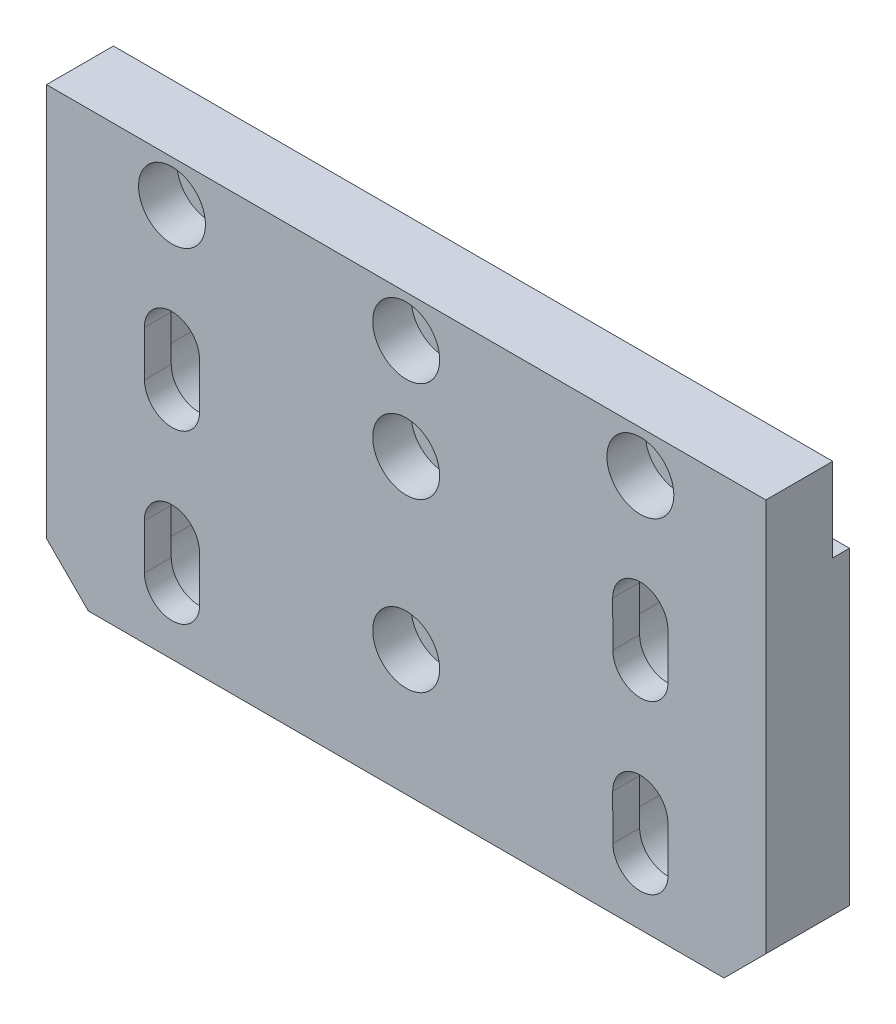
ISO-10303-21;
HEADER;
FILE_DESCRIPTION(('STEP AP214'),'2;1');
FILE_NAME('part.step','',(''),(''),'','','');
FILE_SCHEMA(('AUTOMOTIVE_DESIGN { 1 0 10303 214 1 1 1 1 }'));
ENDSEC;
DATA;
#1=APPLICATION_CONTEXT('core data for automotive mechanical design processes');
#2=APPLICATION_PROTOCOL_DEFINITION('international standard','automotive_design',2000,#1);
#3=PRODUCT_CONTEXT('',#1,'mechanical');
#4=PRODUCT('Part','Part','',(#3));
#5=PRODUCT_RELATED_PRODUCT_CATEGORY('part','',(#4));
#6=PRODUCT_DEFINITION_FORMATION('','',#4);
#7=PRODUCT_DEFINITION_CONTEXT('part definition',#1,'design');
#8=PRODUCT_DEFINITION('design','',#6,#7);
#9=PRODUCT_DEFINITION_SHAPE('','',#8);
#10=(LENGTH_UNIT() NAMED_UNIT(*) SI_UNIT(.MILLI.,.METRE.));
#11=(NAMED_UNIT(*) PLANE_ANGLE_UNIT() SI_UNIT($,.RADIAN.));
#12=(NAMED_UNIT(*) SI_UNIT($,.STERADIAN.) SOLID_ANGLE_UNIT());
#13=UNCERTAINTY_MEASURE_WITH_UNIT(LENGTH_MEASURE(1.E-05),#10,'distance_accuracy_value','');
#14=(GEOMETRIC_REPRESENTATION_CONTEXT(3) GLOBAL_UNCERTAINTY_ASSIGNED_CONTEXT((#13)) GLOBAL_UNIT_ASSIGNED_CONTEXT((#10,
#11,#12)) REPRESENTATION_CONTEXT('',''));
#15=CARTESIAN_POINT('',(0.,0.,0.));
#16=DIRECTION('',(0.,0.,1.));
#17=DIRECTION('',(1.,0.,0.));
#18=AXIS2_PLACEMENT_3D('',#15,#16,#17);
#19=CARTESIAN_POINT('',(0.,0.,10.));
#20=DIRECTION('',(0.,0.,-1.));
#21=DIRECTION('',(-1.,0.,0.));
#22=AXIS2_PLACEMENT_3D('',#19,#20,#21);
#23=PLANE('',#22);
#24=CARTESIAN_POINT('',(77.6258209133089,16.909439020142,10.));
#25=DIRECTION('',(0.,0.,-1.));
#26=DIRECTION('',(-1.,0.,0.));
#27=AXIS2_PLACEMENT_3D('',#24,#25,#26);
#28=CIRCLE('',#27,3.3);
#29=CARTESIAN_POINT('',(80.9257964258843,16.9221518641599,10.));
#30=VERTEX_POINT('',#29);
#31=CARTESIAN_POINT('',(74.3258454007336,16.8967261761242,10.));
#32=VERTEX_POINT('',#31);
#33=EDGE_CURVE('E321',#30,#32,#28,.T.);
#34=ORIENTED_EDGE('',*,*,#33,.T.);
#35=DIRECTION('',(0.00385237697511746,-0.999992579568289,0.));
#36=VECTOR('',#35,1.);
#37=CARTESIAN_POINT('',(74.3050425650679,22.2966861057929,10.));
#38=LINE('',#37,#36);
#39=CARTESIAN_POINT('',(74.3050425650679,22.2966861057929,10.));
#40=VERTEX_POINT('',#39);
#41=EDGE_CURVE('E1287',#40,#32,#38,.T.);
#42=ORIENTED_EDGE('',*,*,#41,.F.);
#43=CARTESIAN_POINT('',(77.6050180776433,22.3093989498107,10.));
#44=DIRECTION('',(0.,0.,-1.));
#45=DIRECTION('',(-1.,0.,0.));
#46=AXIS2_PLACEMENT_3D('',#43,#44,#45);
#47=CIRCLE('',#46,3.3);
#48=CARTESIAN_POINT('',(80.9049935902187,22.3221117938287,10.));
#49=VERTEX_POINT('',#48);
#50=EDGE_CURVE('E306',#40,#49,#47,.T.);
#51=ORIENTED_EDGE('',*,*,#50,.T.);
#52=DIRECTION('',(0.00385237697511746,-0.999992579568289,0.));
#53=VECTOR('',#52,1.);
#54=CARTESIAN_POINT('',(80.9049935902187,22.3221117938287,10.));
#55=LINE('',#54,#53);
#56=EDGE_CURVE('E1281',#49,#30,#55,.T.);
#57=ORIENTED_EDGE('',*,*,#56,.T.);
#58=EDGE_LOOP('',(#34,#42,#51,#57));
#59=FACE_BOUND('',#58,.T.);
#60=DIRECTION('',(0.,-1.,0.));
#61=VECTOR('',#60,1.);
#62=CARTESIAN_POINT('',(6.6154194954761,41.6094189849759,10.));
#63=LINE('',#62,#61);
#64=CARTESIAN_POINT('',(6.6154194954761,41.6094189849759,10.));
#65=VERTEX_POINT('',#64);
#66=CARTESIAN_POINT('',(6.6154194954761,-5.39058101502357,10.));
#67=VERTEX_POINT('',#66);
#68=EDGE_CURVE('E597',#65,#67,#63,.T.);
#69=ORIENTED_EDGE('',*,*,#68,.T.);
#70=DIRECTION('',(-0.707106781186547,0.707106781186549,0.));
#71=VECTOR('',#70,1.);
#72=CARTESIAN_POINT('',(11.6154194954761,-10.3905810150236,10.));
#73=LINE('',#72,#71);
#74=CARTESIAN_POINT('',(11.6154194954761,-10.3905810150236,10.));
#75=VERTEX_POINT('',#74);
#76=EDGE_CURVE('E24',#67,#75,#73,.F.);
#77=ORIENTED_EDGE('',*,*,#76,.T.);
#78=DIRECTION('',(1.,0.,0.));
#79=VECTOR('',#78,1.);
#80=CARTESIAN_POINT('',(6.6154194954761,-10.3905810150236,10.));
#81=LINE('',#80,#79);
#82=CARTESIAN_POINT('',(87.6154194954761,-10.3905810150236,10.));
#83=VERTEX_POINT('',#82);
#84=EDGE_CURVE('E601',#75,#83,#81,.T.);
#85=ORIENTED_EDGE('',*,*,#84,.T.);
#86=DIRECTION('',(-0.707106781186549,-0.707106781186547,0.));
#87=VECTOR('',#86,1.);
#88=CARTESIAN_POINT('',(92.6154194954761,-5.3905810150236,10.));
#89=LINE('',#88,#87);
#90=CARTESIAN_POINT('',(92.6154194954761,-5.39058101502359,10.));
#91=VERTEX_POINT('',#90);
#92=EDGE_CURVE('E635',#83,#91,#89,.F.);
#93=ORIENTED_EDGE('',*,*,#92,.T.);
#94=DIRECTION('',(0.,1.,0.));
#95=VECTOR('',#94,1.);
#96=CARTESIAN_POINT('',(92.6154194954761,41.6094189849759,10.));
#97=LINE('',#96,#95);
#98=CARTESIAN_POINT('',(92.6154194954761,41.6094189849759,10.));
#99=VERTEX_POINT('',#98);
#100=EDGE_CURVE('E604',#91,#99,#97,.T.);
#101=ORIENTED_EDGE('',*,*,#100,.T.);
#102=DIRECTION('',(-1.,0.,0.));
#103=VECTOR('',#102,1.);
#104=CARTESIAN_POINT('',(6.6154194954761,41.6094189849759,10.));
#105=LINE('',#104,#103);
#106=EDGE_CURVE('E594',#99,#65,#105,.T.);
#107=ORIENTED_EDGE('',*,*,#106,.T.);
#108=EDGE_LOOP('',(#69,#77,#85,#93,#101,#107));
#109=FACE_BOUND('',#108,.T.);
#110=CARTESIAN_POINT('',(49.6154194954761,4.60941898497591,10.));
#111=DIRECTION('',(0.,0.,1.));
#112=DIRECTION('',(1.,0.,0.));
#113=AXIS2_PLACEMENT_3D('',#110,#111,#112);
#114=CIRCLE('',#113,4.);
#115=CARTESIAN_POINT('',(53.6154194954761,4.60941898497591,10.));
#116=VERTEX_POINT('',#115);
#117=EDGE_CURVE('E562',#116,#116,#114,.T.);
#118=ORIENTED_EDGE('',*,*,#117,.F.);
#119=EDGE_LOOP('',(#118));
#120=FACE_BOUND('',#119,.T.);
#121=CARTESIAN_POINT('',(49.6154194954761,24.6094189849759,10.));
#122=DIRECTION('',(0.,0.,1.));
#123=DIRECTION('',(1.,0.,0.));
#124=AXIS2_PLACEMENT_3D('',#121,#122,#123);
#125=CIRCLE('',#124,4.);
#126=CARTESIAN_POINT('',(53.6154194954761,24.6094189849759,10.));
#127=VERTEX_POINT('',#126);
#128=EDGE_CURVE('E550',#127,#127,#125,.T.);
#129=ORIENTED_EDGE('',*,*,#128,.F.);
#130=EDGE_LOOP('',(#129));
#131=FACE_BOUND('',#130,.T.);
#132=CARTESIAN_POINT('',(77.6154194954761,36.6094189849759,10.));
#133=DIRECTION('',(0.,0.,1.));
#134=DIRECTION('',(1.,0.,0.));
#135=AXIS2_PLACEMENT_3D('',#132,#133,#134);
#136=CIRCLE('',#135,4.);
#137=CARTESIAN_POINT('',(81.6154194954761,36.6094189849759,10.));
#138=VERTEX_POINT('',#137);
#139=EDGE_CURVE('E540',#138,#138,#136,.T.);
#140=ORIENTED_EDGE('',*,*,#139,.F.);
#141=EDGE_LOOP('',(#140));
#142=FACE_BOUND('',#141,.T.);
#143=CARTESIAN_POINT('',(49.6154194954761,36.6094189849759,10.));
#144=DIRECTION('',(0.,0.,1.));
#145=DIRECTION('',(1.,0.,0.));
#146=AXIS2_PLACEMENT_3D('',#143,#144,#145);
#147=CIRCLE('',#146,4.);
#148=CARTESIAN_POINT('',(53.6154194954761,36.6094189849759,10.));
#149=VERTEX_POINT('',#148);
#150=EDGE_CURVE('E530',#149,#149,#147,.T.);
#151=ORIENTED_EDGE('',*,*,#150,.F.);
#152=EDGE_LOOP('',(#151));
#153=FACE_BOUND('',#152,.T.);
#154=CARTESIAN_POINT('',(21.6154194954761,36.6094189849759,10.));
#155=DIRECTION('',(0.,0.,1.));
#156=DIRECTION('',(1.,0.,0.));
#157=AXIS2_PLACEMENT_3D('',#154,#155,#156);
#158=CIRCLE('',#157,4.);
#159=CARTESIAN_POINT('',(25.6154194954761,36.6094189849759,10.));
#160=VERTEX_POINT('',#159);
#161=EDGE_CURVE('E520',#160,#160,#158,.T.);
#162=ORIENTED_EDGE('',*,*,#161,.F.);
#163=EDGE_LOOP('',(#162));
#164=FACE_BOUND('',#163,.T.);
#165=DIRECTION('',(0.00385237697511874,-0.999992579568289,0.));
#166=VECTOR('',#165,1.);
#167=CARTESIAN_POINT('',(18.3050425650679,22.2966861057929,10.));
#168=LINE('',#167,#166);
#169=CARTESIAN_POINT('',(18.3050425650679,22.2966861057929,10.));
#170=VERTEX_POINT('',#169);
#171=CARTESIAN_POINT('',(18.3258454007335,16.8967261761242,10.));
#172=VERTEX_POINT('',#171);
#173=EDGE_CURVE('E467',#170,#172,#168,.T.);
#174=ORIENTED_EDGE('',*,*,#173,.F.);
#175=CARTESIAN_POINT('',(21.6050180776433,22.3093989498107,10.));
#176=DIRECTION('',(0.,0.,-1.));
#177=DIRECTION('',(-1.,0.,0.));
#178=AXIS2_PLACEMENT_3D('',#175,#176,#177);
#179=CIRCLE('',#178,3.3);
#180=CARTESIAN_POINT('',(24.9049935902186,22.3221117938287,10.));
#181=VERTEX_POINT('',#180);
#182=EDGE_CURVE('E489',#170,#181,#179,.T.);
#183=ORIENTED_EDGE('',*,*,#182,.T.);
#184=DIRECTION('',(0.00385237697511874,-0.999992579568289,0.));
#185=VECTOR('',#184,1.);
#186=CARTESIAN_POINT('',(24.9049935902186,22.3221117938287,10.));
#187=LINE('',#186,#185);
#188=CARTESIAN_POINT('',(24.9257964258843,16.9221518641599,10.));
#189=VERTEX_POINT('',#188);
#190=EDGE_CURVE('E464',#181,#189,#187,.T.);
#191=ORIENTED_EDGE('',*,*,#190,.T.);
#192=CARTESIAN_POINT('',(21.6258209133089,16.909439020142,10.));
#193=DIRECTION('',(0.,0.,-1.));
#194=DIRECTION('',(-1.,0.,0.));
#195=AXIS2_PLACEMENT_3D('',#192,#193,#194);
#196=CIRCLE('',#195,3.3);
#197=EDGE_CURVE('E512',#189,#172,#196,.T.);
#198=ORIENTED_EDGE('',*,*,#197,.T.);
#199=EDGE_LOOP('',(#174,#183,#191,#198));
#200=FACE_BOUND('',#199,.T.);
#201=DIRECTION('',(0.00385237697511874,-0.999992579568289,0.));
#202=VECTOR('',#201,1.);
#203=CARTESIAN_POINT('',(18.3050425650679,2.29668610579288,10.));
#204=LINE('',#203,#202);
#205=CARTESIAN_POINT('',(18.3050425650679,2.29668610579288,10.));
#206=VERTEX_POINT('',#205);
#207=CARTESIAN_POINT('',(18.3258454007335,-3.10327382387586,10.));
#208=VERTEX_POINT('',#207);
#209=EDGE_CURVE('E403',#206,#208,#204,.T.);
#210=ORIENTED_EDGE('',*,*,#209,.F.);
#211=CARTESIAN_POINT('',(21.6050180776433,2.30939894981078,10.));
#212=DIRECTION('',(0.,0.,-1.));
#213=DIRECTION('',(-1.,0.,0.));
#214=AXIS2_PLACEMENT_3D('',#211,#212,#213);
#215=CIRCLE('',#214,3.3);
#216=CARTESIAN_POINT('',(24.9049935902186,2.32211179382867,10.));
#217=VERTEX_POINT('',#216);
#218=EDGE_CURVE('E425',#206,#217,#215,.T.);
#219=ORIENTED_EDGE('',*,*,#218,.T.);
#220=DIRECTION('',(0.00385237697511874,-0.999992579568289,0.));
#221=VECTOR('',#220,1.);
#222=CARTESIAN_POINT('',(24.9049935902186,2.32211179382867,10.));
#223=LINE('',#222,#221);
#224=CARTESIAN_POINT('',(24.9257964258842,-3.07784813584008,10.));
#225=VERTEX_POINT('',#224);
#226=EDGE_CURVE('E400',#217,#225,#223,.T.);
#227=ORIENTED_EDGE('',*,*,#226,.T.);
#228=CARTESIAN_POINT('',(21.6258209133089,-3.09056097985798,10.));
#229=DIRECTION('',(0.,0.,-1.));
#230=DIRECTION('',(-1.,0.,0.));
#231=AXIS2_PLACEMENT_3D('',#228,#229,#230);
#232=CIRCLE('',#231,3.3);
#233=EDGE_CURVE('E448',#225,#208,#232,.T.);
#234=ORIENTED_EDGE('',*,*,#233,.T.);
#235=EDGE_LOOP('',(#210,#219,#227,#234));
#236=FACE_BOUND('',#235,.T.);
#237=DIRECTION('',(0.00385237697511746,-0.999992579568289,0.));
#238=VECTOR('',#237,1.);
#239=CARTESIAN_POINT('',(74.3050425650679,2.29668610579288,10.));
#240=LINE('',#239,#238);
#241=CARTESIAN_POINT('',(74.3050425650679,2.29668610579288,10.));
#242=VERTEX_POINT('',#241);
#243=CARTESIAN_POINT('',(74.3258454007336,-3.10327382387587,10.));
#244=VERTEX_POINT('',#243);
#245=EDGE_CURVE('E339',#242,#244,#240,.T.);
#246=ORIENTED_EDGE('',*,*,#245,.F.);
#247=CARTESIAN_POINT('',(77.6050180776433,2.30939894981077,10.));
#248=DIRECTION('',(0.,0.,-1.));
#249=DIRECTION('',(-1.,0.,0.));
#250=AXIS2_PLACEMENT_3D('',#247,#248,#249);
#251=CIRCLE('',#250,3.3);
#252=CARTESIAN_POINT('',(80.9049935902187,2.32211179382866,10.));
#253=VERTEX_POINT('',#252);
#254=EDGE_CURVE('E361',#242,#253,#251,.T.);
#255=ORIENTED_EDGE('',*,*,#254,.T.);
#256=DIRECTION('',(0.00385237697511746,-0.999992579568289,0.));
#257=VECTOR('',#256,1.);
#258=CARTESIAN_POINT('',(80.9049935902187,2.32211179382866,10.));
#259=LINE('',#258,#257);
#260=CARTESIAN_POINT('',(80.9257964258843,-3.07784813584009,10.));
#261=VERTEX_POINT('',#260);
#262=EDGE_CURVE('E336',#253,#261,#259,.T.);
#263=ORIENTED_EDGE('',*,*,#262,.T.);
#264=CARTESIAN_POINT('',(77.6258209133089,-3.09056097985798,10.));
#265=DIRECTION('',(0.,0.,-1.));
#266=DIRECTION('',(-1.,0.,0.));
#267=AXIS2_PLACEMENT_3D('',#264,#265,#266);
#268=CIRCLE('',#267,3.3);
#269=EDGE_CURVE('E384',#261,#244,#268,.T.);
#270=ORIENTED_EDGE('',*,*,#269,.T.);
#271=EDGE_LOOP('',(#246,#255,#263,#270));
#272=FACE_BOUND('',#271,.T.);
#273=ADVANCED_FACE('F16',(#59,#109,#120,#131,#142,#153,#164,#200,#236,#272),#23,.F.);
#274=CARTESIAN_POINT('',(0.,0.,0.));
#275=DIRECTION('',(0.,0.,-1.));
#276=DIRECTION('',(-1.,0.,0.));
#277=AXIS2_PLACEMENT_3D('',#274,#275,#276);
#278=PLANE('',#277);
#279=DIRECTION('',(0.00385237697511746,-0.999992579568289,0.));
#280=VECTOR('',#279,1.);
#281=CARTESIAN_POINT('',(72.1050588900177,22.2882108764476,0.));
#282=LINE('',#281,#280);
#283=CARTESIAN_POINT('',(72.1050588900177,22.2882108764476,0.));
#284=VERTEX_POINT('',#283);
#285=CARTESIAN_POINT('',(72.1258617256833,16.8882509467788,0.));
#286=VERTEX_POINT('',#285);
#287=EDGE_CURVE('E276',#284,#286,#282,.T.);
#288=ORIENTED_EDGE('',*,*,#287,.T.);
#289=CARTESIAN_POINT('',(77.6258209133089,16.909439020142,0.));
#290=DIRECTION('',(0.,0.,-1.));
#291=DIRECTION('',(-1.,0.,0.));
#292=AXIS2_PLACEMENT_3D('',#289,#290,#291);
#293=CIRCLE('',#292,5.5);
#294=CARTESIAN_POINT('',(83.1257801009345,16.9306270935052,0.));
#295=VERTEX_POINT('',#294);
#296=EDGE_CURVE('E314',#295,#286,#293,.T.);
#297=ORIENTED_EDGE('',*,*,#296,.F.);
#298=DIRECTION('',(0.00385237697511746,-0.999992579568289,0.));
#299=VECTOR('',#298,1.);
#300=CARTESIAN_POINT('',(83.1049772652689,22.3305870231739,0.));
#301=LINE('',#300,#299);
#302=CARTESIAN_POINT('',(83.1049772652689,22.3305870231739,0.));
#303=VERTEX_POINT('',#302);
#304=EDGE_CURVE('E296',#303,#295,#301,.T.);
#305=ORIENTED_EDGE('',*,*,#304,.F.);
#306=CARTESIAN_POINT('',(77.6050180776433,22.3093989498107,0.));
#307=DIRECTION('',(0.,0.,-1.));
#308=DIRECTION('',(-1.,0.,0.));
#309=AXIS2_PLACEMENT_3D('',#306,#307,#308);
#310=CIRCLE('',#309,5.5);
#311=EDGE_CURVE('E39',#284,#303,#310,.T.);
#312=ORIENTED_EDGE('',*,*,#311,.F.);
#313=EDGE_LOOP('',(#288,#297,#305,#312));
#314=FACE_BOUND('',#313,.T.);
#315=DIRECTION('',(0.00385237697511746,-0.999992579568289,0.));
#316=VECTOR('',#315,1.);
#317=CARTESIAN_POINT('',(72.1050588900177,2.28821087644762,0.));
#318=LINE('',#317,#316);
#319=CARTESIAN_POINT('',(72.1050588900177,2.28821087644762,0.));
#320=VERTEX_POINT('',#319);
#321=CARTESIAN_POINT('',(72.1258617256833,-3.11174905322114,0.));
#322=VERTEX_POINT('',#321);
#323=EDGE_CURVE('E345',#320,#322,#318,.T.);
#324=ORIENTED_EDGE('',*,*,#323,.T.);
#325=CARTESIAN_POINT('',(77.6258209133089,-3.09056097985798,0.));
#326=DIRECTION('',(0.,0.,-1.));
#327=DIRECTION('',(-1.,0.,0.));
#328=AXIS2_PLACEMENT_3D('',#325,#326,#327);
#329=CIRCLE('',#328,5.5);
#330=CARTESIAN_POINT('',(83.1257801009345,-3.06937290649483,0.));
#331=VERTEX_POINT('',#330);
#332=EDGE_CURVE('E375',#331,#322,#329,.T.);
#333=ORIENTED_EDGE('',*,*,#332,.F.);
#334=DIRECTION('',(0.00385237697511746,-0.999992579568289,0.));
#335=VECTOR('',#334,1.);
#336=CARTESIAN_POINT('',(83.1049772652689,2.33058702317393,0.));
#337=LINE('',#336,#335);
#338=CARTESIAN_POINT('',(83.1049772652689,2.33058702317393,0.));
#339=VERTEX_POINT('',#338);
#340=EDGE_CURVE('E328',#339,#331,#337,.T.);
#341=ORIENTED_EDGE('',*,*,#340,.F.);
#342=CARTESIAN_POINT('',(77.6050180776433,2.30939894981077,0.));
#343=DIRECTION('',(0.,0.,-1.));
#344=DIRECTION('',(-1.,0.,0.));
#345=AXIS2_PLACEMENT_3D('',#342,#343,#344);
#346=CIRCLE('',#345,5.5);
#347=EDGE_CURVE('E353',#320,#339,#346,.T.);
#348=ORIENTED_EDGE('',*,*,#347,.F.);
#349=EDGE_LOOP('',(#324,#333,#341,#348));
#350=FACE_BOUND('',#349,.T.);
#351=CARTESIAN_POINT('',(21.6258209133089,-3.09056097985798,0.));
#352=DIRECTION('',(0.,0.,-1.));
#353=DIRECTION('',(-1.,0.,0.));
#354=AXIS2_PLACEMENT_3D('',#351,#352,#353);
#355=CIRCLE('',#354,5.5);
#356=CARTESIAN_POINT('',(27.1257801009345,-3.06937290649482,0.));
#357=VERTEX_POINT('',#356);
#358=CARTESIAN_POINT('',(16.1258617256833,-3.11174905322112,0.));
#359=VERTEX_POINT('',#358);
#360=EDGE_CURVE('E439',#357,#359,#355,.T.);
#361=ORIENTED_EDGE('',*,*,#360,.F.);
#362=DIRECTION('',(0.00385237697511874,-0.999992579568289,0.));
#363=VECTOR('',#362,1.);
#364=CARTESIAN_POINT('',(27.1049772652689,2.33058702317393,0.));
#365=LINE('',#364,#363);
#366=CARTESIAN_POINT('',(27.1049772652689,2.33058702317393,0.));
#367=VERTEX_POINT('',#366);
#368=EDGE_CURVE('E392',#367,#357,#365,.T.);
#369=ORIENTED_EDGE('',*,*,#368,.F.);
#370=CARTESIAN_POINT('',(21.6050180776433,2.30939894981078,0.));
#371=DIRECTION('',(0.,0.,-1.));
#372=DIRECTION('',(-1.,0.,0.));
#373=AXIS2_PLACEMENT_3D('',#370,#371,#372);
#374=CIRCLE('',#373,5.5);
#375=CARTESIAN_POINT('',(16.1050588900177,2.28821087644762,0.));
#376=VERTEX_POINT('',#375);
#377=EDGE_CURVE('E417',#376,#367,#374,.T.);
#378=ORIENTED_EDGE('',*,*,#377,.F.);
#379=DIRECTION('',(0.00385237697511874,-0.999992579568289,0.));
#380=VECTOR('',#379,1.);
#381=CARTESIAN_POINT('',(16.1050588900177,2.28821087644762,0.));
#382=LINE('',#381,#380);
#383=EDGE_CURVE('E409',#376,#359,#382,.T.);
#384=ORIENTED_EDGE('',*,*,#383,.T.);
#385=EDGE_LOOP('',(#361,#369,#378,#384));
#386=FACE_BOUND('',#385,.T.);
#387=CARTESIAN_POINT('',(49.6154194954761,24.6094189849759,0.));
#388=DIRECTION('',(0.,0.,1.));
#389=DIRECTION('',(1.,0.,0.));
#390=AXIS2_PLACEMENT_3D('',#387,#388,#389);
#391=CIRCLE('',#390,2.25);
#392=CARTESIAN_POINT('',(51.8654194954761,24.6094189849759,0.));
#393=VERTEX_POINT('',#392);
#394=EDGE_CURVE('E559',#393,#393,#391,.T.);
#395=ORIENTED_EDGE('',*,*,#394,.T.);
#396=EDGE_LOOP('',(#395));
#397=FACE_BOUND('',#396,.T.);
#398=CARTESIAN_POINT('',(49.6154194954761,4.60941898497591,0.));
#399=DIRECTION('',(0.,0.,1.));
#400=DIRECTION('',(1.,0.,0.));
#401=AXIS2_PLACEMENT_3D('',#398,#399,#400);
#402=CIRCLE('',#401,2.25);
#403=CARTESIAN_POINT('',(51.8654194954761,4.60941898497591,0.));
#404=VERTEX_POINT('',#403);
#405=EDGE_CURVE('E571',#404,#404,#402,.T.);
#406=ORIENTED_EDGE('',*,*,#405,.T.);
#407=EDGE_LOOP('',(#406));
#408=FACE_BOUND('',#407,.T.);
#409=DIRECTION('',(1.,0.,0.));
#410=VECTOR('',#409,1.);
#411=CARTESIAN_POINT('',(6.6154194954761,-10.3905810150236,0.));
#412=LINE('',#411,#410);
#413=CARTESIAN_POINT('',(11.6154194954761,-10.3905810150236,0.));
#414=VERTEX_POINT('',#413);
#415=CARTESIAN_POINT('',(87.6154194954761,-10.3905810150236,0.));
#416=VERTEX_POINT('',#415);
#417=EDGE_CURVE('E609',#414,#416,#412,.T.);
#418=ORIENTED_EDGE('',*,*,#417,.F.);
#419=DIRECTION('',(0.707106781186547,-0.707106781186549,0.));
#420=VECTOR('',#419,1.);
#421=CARTESIAN_POINT('',(0.612419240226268,0.612419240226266,0.));
#422=LINE('',#421,#420);
#423=CARTESIAN_POINT('',(6.6154194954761,-5.39058101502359,0.));
#424=VERTEX_POINT('',#423);
#425=EDGE_CURVE('E631',#414,#424,#422,.F.);
#426=ORIENTED_EDGE('',*,*,#425,.T.);
#427=DIRECTION('',(0.,-1.,0.));
#428=VECTOR('',#427,1.);
#429=CARTESIAN_POINT('',(6.6154194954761,41.6094189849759,0.));
#430=LINE('',#429,#428);
#431=CARTESIAN_POINT('',(6.6154194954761,31.6094189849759,0.));
#432=VERTEX_POINT('',#431);
#433=EDGE_CURVE('E590',#432,#424,#430,.T.);
#434=ORIENTED_EDGE('',*,*,#433,.F.);
#435=DIRECTION('',(1.,0.,0.));
#436=VECTOR('',#435,1.);
#437=CARTESIAN_POINT('',(6.6154194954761,31.6094189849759,0.));
#438=LINE('',#437,#436);
#439=CARTESIAN_POINT('',(92.6154194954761,31.6094189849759,0.));
#440=VERTEX_POINT('',#439);
#441=EDGE_CURVE('E587',#432,#440,#438,.T.);
#442=ORIENTED_EDGE('',*,*,#441,.T.);
#443=DIRECTION('',(0.,1.,0.));
#444=VECTOR('',#443,1.);
#445=CARTESIAN_POINT('',(92.6154194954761,41.6094189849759,0.));
#446=LINE('',#445,#444);
#447=CARTESIAN_POINT('',(92.6154194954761,-5.39058101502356,0.));
#448=VERTEX_POINT('',#447);
#449=EDGE_CURVE('E598',#448,#440,#446,.T.);
#450=ORIENTED_EDGE('',*,*,#449,.F.);
#451=DIRECTION('',(0.707106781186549,0.707106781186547,0.));
#452=VECTOR('',#451,1.);
#453=CARTESIAN_POINT('',(49.0030002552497,-49.0030002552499,0.));
#454=LINE('',#453,#452);
#455=EDGE_CURVE('E629',#448,#416,#454,.F.);
#456=ORIENTED_EDGE('',*,*,#455,.T.);
#457=EDGE_LOOP('',(#418,#426,#434,#442,#450,#456));
#458=FACE_BOUND('',#457,.T.);
#459=CARTESIAN_POINT('',(21.6050180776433,22.3093989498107,0.));
#460=DIRECTION('',(0.,0.,-1.));
#461=DIRECTION('',(-1.,0.,0.));
#462=AXIS2_PLACEMENT_3D('',#459,#460,#461);
#463=CIRCLE('',#462,5.5);
#464=CARTESIAN_POINT('',(16.1050588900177,22.2882108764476,0.));
#465=VERTEX_POINT('',#464);
#466=CARTESIAN_POINT('',(27.1049772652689,22.3305870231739,0.));
#467=VERTEX_POINT('',#466);
#468=EDGE_CURVE('E481',#465,#467,#463,.T.);
#469=ORIENTED_EDGE('',*,*,#468,.F.);
#470=DIRECTION('',(0.00385237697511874,-0.999992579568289,0.));
#471=VECTOR('',#470,1.);
#472=CARTESIAN_POINT('',(16.1050588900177,22.2882108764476,0.));
#473=LINE('',#472,#471);
#474=CARTESIAN_POINT('',(16.1258617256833,16.8882509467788,0.));
#475=VERTEX_POINT('',#474);
#476=EDGE_CURVE('E473',#465,#475,#473,.T.);
#477=ORIENTED_EDGE('',*,*,#476,.T.);
#478=CARTESIAN_POINT('',(21.6258209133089,16.909439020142,0.));
#479=DIRECTION('',(0.,0.,-1.));
#480=DIRECTION('',(-1.,0.,0.));
#481=AXIS2_PLACEMENT_3D('',#478,#479,#480);
#482=CIRCLE('',#481,5.5);
#483=CARTESIAN_POINT('',(27.1257801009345,16.9306270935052,0.));
#484=VERTEX_POINT('',#483);
#485=EDGE_CURVE('E503',#484,#475,#482,.T.);
#486=ORIENTED_EDGE('',*,*,#485,.F.);
#487=DIRECTION('',(0.00385237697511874,-0.999992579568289,0.));
#488=VECTOR('',#487,1.);
#489=CARTESIAN_POINT('',(27.1049772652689,22.3305870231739,0.));
#490=LINE('',#489,#488);
#491=EDGE_CURVE('E456',#467,#484,#490,.T.);
#492=ORIENTED_EDGE('',*,*,#491,.F.);
#493=EDGE_LOOP('',(#469,#477,#486,#492));
#494=FACE_BOUND('',#493,.T.);
#495=ADVANCED_FACE('F294',(#314,#350,#386,#397,#408,#458,#494),#278,.T.);
#496=CARTESIAN_POINT('',(6.6154194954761,41.6094189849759,10.));
#497=DIRECTION('',(0.,-1.,0.));
#498=DIRECTION('',(0.,0.,-1.));
#499=AXIS2_PLACEMENT_3D('',#496,#497,#498);
#500=PLANE('',#499);
#501=DIRECTION('',(0.,0.,-1.));
#502=VECTOR('',#501,1.);
#503=CARTESIAN_POINT('',(92.6154194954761,41.6094189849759,10.));
#504=LINE('',#503,#502);
#505=CARTESIAN_POINT('',(92.6154194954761,41.6094189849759,2.));
#506=VERTEX_POINT('',#505);
#507=EDGE_CURVE('E606',#99,#506,#504,.T.);
#508=ORIENTED_EDGE('',*,*,#507,.T.);
#509=DIRECTION('',(1.,0.,0.));
#510=VECTOR('',#509,1.);
#511=CARTESIAN_POINT('',(6.6154194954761,41.6094189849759,2.));
#512=LINE('',#511,#510);
#513=CARTESIAN_POINT('',(6.6154194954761,41.6094189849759,2.));
#514=VERTEX_POINT('',#513);
#515=EDGE_CURVE('E582',#514,#506,#512,.T.);
#516=ORIENTED_EDGE('',*,*,#515,.F.);
#517=DIRECTION('',(0.,0.,-1.));
#518=VECTOR('',#517,1.);
#519=CARTESIAN_POINT('',(6.6154194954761,41.6094189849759,10.));
#520=LINE('',#519,#518);
#521=EDGE_CURVE('E615',#65,#514,#520,.T.);
#522=ORIENTED_EDGE('',*,*,#521,.F.);
#523=ORIENTED_EDGE('',*,*,#106,.F.);
#524=EDGE_LOOP('',(#508,#516,#522,#523));
#525=FACE_BOUND('',#524,.T.);
#526=ADVANCED_FACE('F670',(#525),#500,.F.);
#527=CARTESIAN_POINT('',(6.6154194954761,41.6094189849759,10.));
#528=DIRECTION('',(1.,0.,0.));
#529=DIRECTION('',(0.,0.,-1.));
#530=AXIS2_PLACEMENT_3D('',#527,#528,#529);
#531=PLANE('',#530);
#532=ORIENTED_EDGE('',*,*,#433,.T.);
#533=DIRECTION('',(0.,0.,1.));
#534=VECTOR('',#533,1.);
#535=CARTESIAN_POINT('',(6.6154194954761,-5.39058101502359,10.));
#536=LINE('',#535,#534);
#537=EDGE_CURVE('E633',#424,#67,#536,.T.);
#538=ORIENTED_EDGE('',*,*,#537,.T.);
#539=ORIENTED_EDGE('',*,*,#68,.F.);
#540=ORIENTED_EDGE('',*,*,#521,.T.);
#541=DIRECTION('',(0.,-1.,0.));
#542=VECTOR('',#541,1.);
#543=CARTESIAN_POINT('',(6.6154194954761,41.6094189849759,2.));
#544=LINE('',#543,#542);
#545=CARTESIAN_POINT('',(6.6154194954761,31.6094189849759,2.));
#546=VERTEX_POINT('',#545);
#547=EDGE_CURVE('E575',#514,#546,#544,.T.);
#548=ORIENTED_EDGE('',*,*,#547,.T.);
#549=DIRECTION('',(0.,0.,-1.));
#550=VECTOR('',#549,1.);
#551=CARTESIAN_POINT('',(6.6154194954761,31.6094189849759,0.));
#552=LINE('',#551,#550);
#553=EDGE_CURVE('E578',#546,#432,#552,.T.);
#554=ORIENTED_EDGE('',*,*,#553,.T.);
#555=EDGE_LOOP('',(#532,#538,#539,#540,#548,#554));
#556=FACE_BOUND('',#555,.T.);
#557=ADVANCED_FACE('F653',(#556),#531,.F.);
#558=CARTESIAN_POINT('',(6.6154194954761,-10.3905810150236,10.));
#559=DIRECTION('',(0.,1.,0.));
#560=DIRECTION('',(0.,0.,1.));
#561=AXIS2_PLACEMENT_3D('',#558,#559,#560);
#562=PLANE('',#561);
#563=ORIENTED_EDGE('',*,*,#84,.F.);
#564=DIRECTION('',(0.,0.,-1.));
#565=VECTOR('',#564,1.);
#566=CARTESIAN_POINT('',(11.6154194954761,-10.3905810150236,10.));
#567=LINE('',#566,#565);
#568=EDGE_CURVE('E626',#75,#414,#567,.T.);
#569=ORIENTED_EDGE('',*,*,#568,.T.);
#570=ORIENTED_EDGE('',*,*,#417,.T.);
#571=DIRECTION('',(0.,0.,1.));
#572=VECTOR('',#571,1.);
#573=CARTESIAN_POINT('',(87.6154194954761,-10.3905810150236,10.));
#574=LINE('',#573,#572);
#575=EDGE_CURVE('E618',#416,#83,#574,.T.);
#576=ORIENTED_EDGE('',*,*,#575,.T.);
#577=EDGE_LOOP('',(#563,#569,#570,#576));
#578=FACE_BOUND('',#577,.T.);
#579=ADVANCED_FACE('F645',(#578),#562,.F.);
#580=CARTESIAN_POINT('',(92.6154194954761,41.6094189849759,10.));
#581=DIRECTION('',(-1.,0.,0.));
#582=DIRECTION('',(0.,0.,1.));
#583=AXIS2_PLACEMENT_3D('',#580,#581,#582);
#584=PLANE('',#583);
#585=ORIENTED_EDGE('',*,*,#100,.F.);
#586=DIRECTION('',(0.,0.,-1.));
#587=VECTOR('',#586,1.);
#588=CARTESIAN_POINT('',(92.6154194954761,-5.3905810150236,10.));
#589=LINE('',#588,#587);
#590=EDGE_CURVE('E11',#91,#448,#589,.T.);
#591=ORIENTED_EDGE('',*,*,#590,.T.);
#592=ORIENTED_EDGE('',*,*,#449,.T.);
#593=DIRECTION('',(0.,0.,-1.));
#594=VECTOR('',#593,1.);
#595=CARTESIAN_POINT('',(92.6154194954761,31.6094189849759,0.));
#596=LINE('',#595,#594);
#597=CARTESIAN_POINT('',(92.6154194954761,31.6094189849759,2.));
#598=VERTEX_POINT('',#597);
#599=EDGE_CURVE('E579',#598,#440,#596,.T.);
#600=ORIENTED_EDGE('',*,*,#599,.F.);
#601=DIRECTION('',(0.,-1.,0.));
#602=VECTOR('',#601,1.);
#603=CARTESIAN_POINT('',(92.6154194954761,41.6094189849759,2.));
#604=LINE('',#603,#602);
#605=EDGE_CURVE('E574',#506,#598,#604,.T.);
#606=ORIENTED_EDGE('',*,*,#605,.F.);
#607=ORIENTED_EDGE('',*,*,#507,.F.);
#608=EDGE_LOOP('',(#585,#591,#592,#600,#606,#607));
#609=FACE_BOUND('',#608,.T.);
#610=ADVANCED_FACE('F661',(#609),#584,.F.);
#611=CARTESIAN_POINT('',(6.6154194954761,31.6094189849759,0.));
#612=DIRECTION('',(0.,-1.,0.));
#613=DIRECTION('',(0.,0.,-1.));
#614=AXIS2_PLACEMENT_3D('',#611,#612,#613);
#615=PLANE('',#614);
#616=ORIENTED_EDGE('',*,*,#599,.T.);
#617=ORIENTED_EDGE('',*,*,#441,.F.);
#618=ORIENTED_EDGE('',*,*,#553,.F.);
#619=DIRECTION('',(1.,0.,0.));
#620=VECTOR('',#619,1.);
#621=CARTESIAN_POINT('',(6.6154194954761,31.6094189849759,2.));
#622=LINE('',#621,#620);
#623=EDGE_CURVE('E591',#546,#598,#622,.T.);
#624=ORIENTED_EDGE('',*,*,#623,.T.);
#625=EDGE_LOOP('',(#616,#617,#618,#624));
#626=FACE_BOUND('',#625,.T.);
#627=ADVANCED_FACE('F656',(#626),#615,.F.);
#628=CARTESIAN_POINT('',(6.6154194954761,41.6094189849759,2.));
#629=DIRECTION('',(0.,0.,1.));
#630=DIRECTION('',(0.,-1.,0.));
#631=AXIS2_PLACEMENT_3D('',#628,#629,#630);
#632=PLANE('',#631);
#633=CARTESIAN_POINT('',(21.6154194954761,36.6094189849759,2.));
#634=DIRECTION('',(0.,0.,1.));
#635=DIRECTION('',(0.,-1.,0.));
#636=AXIS2_PLACEMENT_3D('',#633,#634,#635);
#637=CIRCLE('',#636,2.25);
#638=CARTESIAN_POINT('',(21.6154194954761,34.3594189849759,2.));
#639=VERTEX_POINT('',#638);
#640=EDGE_CURVE('E529',#639,#639,#637,.T.);
#641=ORIENTED_EDGE('',*,*,#640,.T.);
#642=EDGE_LOOP('',(#641));
#643=FACE_BOUND('',#642,.T.);
#644=CARTESIAN_POINT('',(49.6154194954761,36.6094189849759,2.));
#645=DIRECTION('',(0.,0.,1.));
#646=DIRECTION('',(0.,-1.,0.));
#647=AXIS2_PLACEMENT_3D('',#644,#645,#646);
#648=CIRCLE('',#647,2.25);
#649=CARTESIAN_POINT('',(49.6154194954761,34.3594189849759,2.));
#650=VERTEX_POINT('',#649);
#651=EDGE_CURVE('E539',#650,#650,#648,.T.);
#652=ORIENTED_EDGE('',*,*,#651,.T.);
#653=EDGE_LOOP('',(#652));
#654=FACE_BOUND('',#653,.T.);
#655=CARTESIAN_POINT('',(77.6154194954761,36.6094189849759,2.));
#656=DIRECTION('',(0.,0.,1.));
#657=DIRECTION('',(0.,-1.,0.));
#658=AXIS2_PLACEMENT_3D('',#655,#656,#657);
#659=CIRCLE('',#658,2.25);
#660=CARTESIAN_POINT('',(77.6154194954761,34.3594189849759,2.));
#661=VERTEX_POINT('',#660);
#662=EDGE_CURVE('E549',#661,#661,#659,.T.);
#663=ORIENTED_EDGE('',*,*,#662,.T.);
#664=EDGE_LOOP('',(#663));
#665=FACE_BOUND('',#664,.T.);
#666=ORIENTED_EDGE('',*,*,#605,.T.);
#667=ORIENTED_EDGE('',*,*,#623,.F.);
#668=ORIENTED_EDGE('',*,*,#547,.F.);
#669=ORIENTED_EDGE('',*,*,#515,.T.);
#670=EDGE_LOOP('',(#666,#667,#668,#669));
#671=FACE_BOUND('',#670,.T.);
#672=ADVANCED_FACE('F672',(#643,#654,#665,#671),#632,.F.);
#673=CARTESIAN_POINT('',(49.6154194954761,4.60941898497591,10.));
#674=DIRECTION('',(0.,0.,1.));
#675=DIRECTION('',(1.,0.,0.));
#676=AXIS2_PLACEMENT_3D('',#673,#674,#675);
#677=CYLINDRICAL_SURFACE('',#676,2.25);
#678=ORIENTED_EDGE('',*,*,#405,.F.);
#679=EDGE_LOOP('',(#678));
#680=FACE_BOUND('',#679,.T.);
#681=CARTESIAN_POINT('',(49.6154194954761,4.60941898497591,5.4));
#682=DIRECTION('',(0.,0.,1.));
#683=DIRECTION('',(1.,0.,0.));
#684=AXIS2_PLACEMENT_3D('',#681,#682,#683);
#685=CIRCLE('',#684,2.25);
#686=CARTESIAN_POINT('',(51.8654194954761,4.60941898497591,5.4));
#687=VERTEX_POINT('',#686);
#688=EDGE_CURVE('E568',#687,#687,#685,.T.);
#689=ORIENTED_EDGE('',*,*,#688,.T.);
#690=EDGE_LOOP('',(#689));
#691=FACE_BOUND('',#690,.T.);
#692=ADVANCED_FACE('F674',(#680,#691),#677,.F.);
#693=CARTESIAN_POINT('',(51.8654194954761,4.60941898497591,5.4));
#694=DIRECTION('',(0.,0.,-1.));
#695=DIRECTION('',(-1.,0.,0.));
#696=AXIS2_PLACEMENT_3D('',#693,#694,#695);
#697=PLANE('',#696);
#698=ORIENTED_EDGE('',*,*,#688,.F.);
#699=EDGE_LOOP('',(#698));
#700=FACE_BOUND('',#699,.T.);
#701=CARTESIAN_POINT('',(49.6154194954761,4.60941898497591,5.4));
#702=DIRECTION('',(0.,0.,1.));
#703=DIRECTION('',(1.,0.,0.));
#704=AXIS2_PLACEMENT_3D('',#701,#702,#703);
#705=CIRCLE('',#704,4.);
#706=CARTESIAN_POINT('',(53.6154194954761,4.60941898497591,5.4));
#707=VERTEX_POINT('',#706);
#708=EDGE_CURVE('E565',#707,#707,#705,.T.);
#709=ORIENTED_EDGE('',*,*,#708,.T.);
#710=EDGE_LOOP('',(#709));
#711=FACE_BOUND('',#710,.T.);
#712=ADVANCED_FACE('F683',(#700,#711),#697,.F.);
#713=CARTESIAN_POINT('',(49.6154194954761,4.60941898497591,10.));
#714=DIRECTION('',(0.,0.,1.));
#715=DIRECTION('',(1.,0.,0.));
#716=AXIS2_PLACEMENT_3D('',#713,#714,#715);
#717=CYLINDRICAL_SURFACE('',#716,4.);
#718=ORIENTED_EDGE('',*,*,#708,.F.);
#719=EDGE_LOOP('',(#718));
#720=FACE_BOUND('',#719,.T.);
#721=ORIENTED_EDGE('',*,*,#117,.T.);
#722=EDGE_LOOP('',(#721));
#723=FACE_BOUND('',#722,.T.);
#724=ADVANCED_FACE('F765',(#720,#723),#717,.F.);
#725=CARTESIAN_POINT('',(49.6154194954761,24.6094189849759,10.));
#726=DIRECTION('',(0.,0.,1.));
#727=DIRECTION('',(1.,0.,0.));
#728=AXIS2_PLACEMENT_3D('',#725,#726,#727);
#729=CYLINDRICAL_SURFACE('',#728,2.25);
#730=ORIENTED_EDGE('',*,*,#394,.F.);
#731=EDGE_LOOP('',(#730));
#732=FACE_BOUND('',#731,.T.);
#733=CARTESIAN_POINT('',(49.6154194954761,24.6094189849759,5.4));
#734=DIRECTION('',(0.,0.,1.));
#735=DIRECTION('',(1.,0.,0.));
#736=AXIS2_PLACEMENT_3D('',#733,#734,#735);
#737=CIRCLE('',#736,2.25);
#738=CARTESIAN_POINT('',(51.8654194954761,24.6094189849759,5.4));
#739=VERTEX_POINT('',#738);
#740=EDGE_CURVE('E556',#739,#739,#737,.T.);
#741=ORIENTED_EDGE('',*,*,#740,.T.);
#742=EDGE_LOOP('',(#741));
#743=FACE_BOUND('',#742,.T.);
#744=ADVANCED_FACE('F761',(#732,#743),#729,.F.);
#745=CARTESIAN_POINT('',(51.8654194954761,24.6094189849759,5.4));
#746=DIRECTION('',(0.,0.,-1.));
#747=DIRECTION('',(-1.,0.,0.));
#748=AXIS2_PLACEMENT_3D('',#745,#746,#747);
#749=PLANE('',#748);
#750=ORIENTED_EDGE('',*,*,#740,.F.);
#751=EDGE_LOOP('',(#750));
#752=FACE_BOUND('',#751,.T.);
#753=CARTESIAN_POINT('',(49.6154194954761,24.6094189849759,5.4));
#754=DIRECTION('',(0.,0.,1.));
#755=DIRECTION('',(1.,0.,0.));
#756=AXIS2_PLACEMENT_3D('',#753,#754,#755);
#757=CIRCLE('',#756,4.);
#758=CARTESIAN_POINT('',(53.6154194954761,24.6094189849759,5.4));
#759=VERTEX_POINT('',#758);
#760=EDGE_CURVE('E553',#759,#759,#757,.T.);
#761=ORIENTED_EDGE('',*,*,#760,.T.);
#762=EDGE_LOOP('',(#761));
#763=FACE_BOUND('',#762,.T.);
#764=ADVANCED_FACE('F757',(#752,#763),#749,.F.);
#765=CARTESIAN_POINT('',(49.6154194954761,24.6094189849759,10.));
#766=DIRECTION('',(0.,0.,1.));
#767=DIRECTION('',(1.,0.,0.));
#768=AXIS2_PLACEMENT_3D('',#765,#766,#767);
#769=CYLINDRICAL_SURFACE('',#768,4.);
#770=ORIENTED_EDGE('',*,*,#760,.F.);
#771=EDGE_LOOP('',(#770));
#772=FACE_BOUND('',#771,.T.);
#773=ORIENTED_EDGE('',*,*,#128,.T.);
#774=EDGE_LOOP('',(#773));
#775=FACE_BOUND('',#774,.T.);
#776=ADVANCED_FACE('F753',(#772,#775),#769,.F.);
#777=CARTESIAN_POINT('',(77.6154194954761,36.6094189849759,10.));
#778=DIRECTION('',(0.,0.,1.));
#779=DIRECTION('',(1.,0.,0.));
#780=AXIS2_PLACEMENT_3D('',#777,#778,#779);
#781=CYLINDRICAL_SURFACE('',#780,2.25);
#782=CARTESIAN_POINT('',(77.6154194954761,36.6094189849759,5.4));
#783=DIRECTION('',(0.,0.,1.));
#784=DIRECTION('',(1.,0.,0.));
#785=AXIS2_PLACEMENT_3D('',#782,#783,#784);
#786=CIRCLE('',#785,2.25);
#787=CARTESIAN_POINT('',(79.8654194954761,36.6094189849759,5.4));
#788=VERTEX_POINT('',#787);
#789=EDGE_CURVE('E546',#788,#788,#786,.T.);
#790=ORIENTED_EDGE('',*,*,#789,.T.);
#791=EDGE_LOOP('',(#790));
#792=FACE_BOUND('',#791,.T.);
#793=ORIENTED_EDGE('',*,*,#662,.F.);
#794=EDGE_LOOP('',(#793));
#795=FACE_BOUND('',#794,.T.);
#796=ADVANCED_FACE('F749',(#792,#795),#781,.F.);
#797=CARTESIAN_POINT('',(79.8654194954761,36.6094189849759,5.4));
#798=DIRECTION('',(0.,0.,-1.));
#799=DIRECTION('',(-1.,0.,0.));
#800=AXIS2_PLACEMENT_3D('',#797,#798,#799);
#801=PLANE('',#800);
#802=ORIENTED_EDGE('',*,*,#789,.F.);
#803=EDGE_LOOP('',(#802));
#804=FACE_BOUND('',#803,.T.);
#805=CARTESIAN_POINT('',(77.6154194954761,36.6094189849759,5.4));
#806=DIRECTION('',(0.,0.,1.));
#807=DIRECTION('',(1.,0.,0.));
#808=AXIS2_PLACEMENT_3D('',#805,#806,#807);
#809=CIRCLE('',#808,4.);
#810=CARTESIAN_POINT('',(81.6154194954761,36.6094189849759,5.4));
#811=VERTEX_POINT('',#810);
#812=EDGE_CURVE('E543',#811,#811,#809,.T.);
#813=ORIENTED_EDGE('',*,*,#812,.T.);
#814=EDGE_LOOP('',(#813));
#815=FACE_BOUND('',#814,.T.);
#816=ADVANCED_FACE('F745',(#804,#815),#801,.F.);
#817=CARTESIAN_POINT('',(77.6154194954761,36.6094189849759,10.));
#818=DIRECTION('',(0.,0.,1.));
#819=DIRECTION('',(1.,0.,0.));
#820=AXIS2_PLACEMENT_3D('',#817,#818,#819);
#821=CYLINDRICAL_SURFACE('',#820,4.);
#822=ORIENTED_EDGE('',*,*,#812,.F.);
#823=EDGE_LOOP('',(#822));
#824=FACE_BOUND('',#823,.T.);
#825=ORIENTED_EDGE('',*,*,#139,.T.);
#826=EDGE_LOOP('',(#825));
#827=FACE_BOUND('',#826,.T.);
#828=ADVANCED_FACE('F741',(#824,#827),#821,.F.);
#829=CARTESIAN_POINT('',(49.6154194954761,36.6094189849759,10.));
#830=DIRECTION('',(0.,0.,1.));
#831=DIRECTION('',(1.,0.,0.));
#832=AXIS2_PLACEMENT_3D('',#829,#830,#831);
#833=CYLINDRICAL_SURFACE('',#832,2.25);
#834=CARTESIAN_POINT('',(49.6154194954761,36.6094189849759,5.4));
#835=DIRECTION('',(0.,0.,1.));
#836=DIRECTION('',(1.,0.,0.));
#837=AXIS2_PLACEMENT_3D('',#834,#835,#836);
#838=CIRCLE('',#837,2.25);
#839=CARTESIAN_POINT('',(51.8654194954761,36.6094189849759,5.4));
#840=VERTEX_POINT('',#839);
#841=EDGE_CURVE('E536',#840,#840,#838,.T.);
#842=ORIENTED_EDGE('',*,*,#841,.T.);
#843=EDGE_LOOP('',(#842));
#844=FACE_BOUND('',#843,.T.);
#845=ORIENTED_EDGE('',*,*,#651,.F.);
#846=EDGE_LOOP('',(#845));
#847=FACE_BOUND('',#846,.T.);
#848=ADVANCED_FACE('F737',(#844,#847),#833,.F.);
#849=CARTESIAN_POINT('',(51.8654194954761,36.6094189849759,5.4));
#850=DIRECTION('',(0.,0.,-1.));
#851=DIRECTION('',(-1.,0.,0.));
#852=AXIS2_PLACEMENT_3D('',#849,#850,#851);
#853=PLANE('',#852);
#854=ORIENTED_EDGE('',*,*,#841,.F.);
#855=EDGE_LOOP('',(#854));
#856=FACE_BOUND('',#855,.T.);
#857=CARTESIAN_POINT('',(49.6154194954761,36.6094189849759,5.4));
#858=DIRECTION('',(0.,0.,1.));
#859=DIRECTION('',(1.,0.,0.));
#860=AXIS2_PLACEMENT_3D('',#857,#858,#859);
#861=CIRCLE('',#860,4.);
#862=CARTESIAN_POINT('',(53.6154194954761,36.6094189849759,5.4));
#863=VERTEX_POINT('',#862);
#864=EDGE_CURVE('E533',#863,#863,#861,.T.);
#865=ORIENTED_EDGE('',*,*,#864,.T.);
#866=EDGE_LOOP('',(#865));
#867=FACE_BOUND('',#866,.T.);
#868=ADVANCED_FACE('F733',(#856,#867),#853,.F.);
#869=CARTESIAN_POINT('',(49.6154194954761,36.6094189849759,10.));
#870=DIRECTION('',(0.,0.,1.));
#871=DIRECTION('',(1.,0.,0.));
#872=AXIS2_PLACEMENT_3D('',#869,#870,#871);
#873=CYLINDRICAL_SURFACE('',#872,4.);
#874=ORIENTED_EDGE('',*,*,#864,.F.);
#875=EDGE_LOOP('',(#874));
#876=FACE_BOUND('',#875,.T.);
#877=ORIENTED_EDGE('',*,*,#150,.T.);
#878=EDGE_LOOP('',(#877));
#879=FACE_BOUND('',#878,.T.);
#880=ADVANCED_FACE('F729',(#876,#879),#873,.F.);
#881=CARTESIAN_POINT('',(21.6154194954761,36.6094189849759,10.));
#882=DIRECTION('',(0.,0.,1.));
#883=DIRECTION('',(1.,0.,0.));
#884=AXIS2_PLACEMENT_3D('',#881,#882,#883);
#885=CYLINDRICAL_SURFACE('',#884,2.25);
#886=CARTESIAN_POINT('',(21.6154194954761,36.6094189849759,5.4));
#887=DIRECTION('',(0.,0.,1.));
#888=DIRECTION('',(1.,0.,0.));
#889=AXIS2_PLACEMENT_3D('',#886,#887,#888);
#890=CIRCLE('',#889,2.25);
#891=CARTESIAN_POINT('',(23.8654194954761,36.6094189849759,5.4));
#892=VERTEX_POINT('',#891);
#893=EDGE_CURVE('E526',#892,#892,#890,.T.);
#894=ORIENTED_EDGE('',*,*,#893,.T.);
#895=EDGE_LOOP('',(#894));
#896=FACE_BOUND('',#895,.T.);
#897=ORIENTED_EDGE('',*,*,#640,.F.);
#898=EDGE_LOOP('',(#897));
#899=FACE_BOUND('',#898,.T.);
#900=ADVANCED_FACE('F719',(#896,#899),#885,.F.);
#901=CARTESIAN_POINT('',(23.8654194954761,36.6094189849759,5.4));
#902=DIRECTION('',(0.,0.,-1.));
#903=DIRECTION('',(-1.,0.,0.));
#904=AXIS2_PLACEMENT_3D('',#901,#902,#903);
#905=PLANE('',#904);
#906=ORIENTED_EDGE('',*,*,#893,.F.);
#907=EDGE_LOOP('',(#906));
#908=FACE_BOUND('',#907,.T.);
#909=CARTESIAN_POINT('',(21.6154194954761,36.6094189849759,5.4));
#910=DIRECTION('',(0.,0.,1.));
#911=DIRECTION('',(1.,0.,0.));
#912=AXIS2_PLACEMENT_3D('',#909,#910,#911);
#913=CIRCLE('',#912,4.);
#914=CARTESIAN_POINT('',(25.6154194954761,36.6094189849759,5.4));
#915=VERTEX_POINT('',#914);
#916=EDGE_CURVE('E523',#915,#915,#913,.T.);
#917=ORIENTED_EDGE('',*,*,#916,.T.);
#918=EDGE_LOOP('',(#917));
#919=FACE_BOUND('',#918,.T.);
#920=ADVANCED_FACE('F712',(#908,#919),#905,.F.);
#921=CARTESIAN_POINT('',(21.6154194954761,36.6094189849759,10.));
#922=DIRECTION('',(0.,0.,1.));
#923=DIRECTION('',(1.,0.,0.));
#924=AXIS2_PLACEMENT_3D('',#921,#922,#923);
#925=CYLINDRICAL_SURFACE('',#924,4.);
#926=ORIENTED_EDGE('',*,*,#916,.F.);
#927=EDGE_LOOP('',(#926));
#928=FACE_BOUND('',#927,.T.);
#929=ORIENTED_EDGE('',*,*,#161,.T.);
#930=EDGE_LOOP('',(#929));
#931=FACE_BOUND('',#930,.T.);
#932=ADVANCED_FACE('F705',(#928,#931),#925,.F.);
#933=CARTESIAN_POINT('',(11.6154194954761,-10.3905810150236,10.));
#934=DIRECTION('',(0.707106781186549,0.707106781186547,0.));
#935=DIRECTION('',(0.,0.,-1.));
#936=AXIS2_PLACEMENT_3D('',#933,#934,#935);
#937=PLANE('',#936);
#938=ORIENTED_EDGE('',*,*,#76,.F.);
#939=ORIENTED_EDGE('',*,*,#537,.F.);
#940=ORIENTED_EDGE('',*,*,#425,.F.);
#941=ORIENTED_EDGE('',*,*,#568,.F.);
#942=EDGE_LOOP('',(#938,#939,#940,#941));
#943=FACE_BOUND('',#942,.T.);
#944=ADVANCED_FACE('F648',(#943),#937,.F.);
#945=CARTESIAN_POINT('',(92.6154194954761,-5.3905810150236,10.));
#946=DIRECTION('',(-0.707106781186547,0.707106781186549,0.));
#947=DIRECTION('',(0.,0.,-1.));
#948=AXIS2_PLACEMENT_3D('',#945,#946,#947);
#949=PLANE('',#948);
#950=ORIENTED_EDGE('',*,*,#92,.F.);
#951=ORIENTED_EDGE('',*,*,#575,.F.);
#952=ORIENTED_EDGE('',*,*,#455,.F.);
#953=ORIENTED_EDGE('',*,*,#590,.F.);
#954=EDGE_LOOP('',(#950,#951,#952,#953));
#955=FACE_BOUND('',#954,.T.);
#956=ADVANCED_FACE('F18',(#955),#949,.F.);
#957=CARTESIAN_POINT('',(21.6258209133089,16.909439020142,0.));
#958=DIRECTION('',(0.,0.,-1.));
#959=DIRECTION('',(-1.,0.,0.));
#960=AXIS2_PLACEMENT_3D('',#957,#958,#959);
#961=CYLINDRICAL_SURFACE('',#960,3.3);
#962=ORIENTED_EDGE('',*,*,#197,.F.);
#963=DIRECTION('',(0.,0.,-1.));
#964=VECTOR('',#963,1.);
#965=CARTESIAN_POINT('',(24.9257964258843,16.9221518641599,0.));
#966=LINE('',#965,#964);
#967=CARTESIAN_POINT('',(24.9257964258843,16.9221518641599,6.8));
#968=VERTEX_POINT('',#967);
#969=EDGE_CURVE('E501',#968,#189,#966,.F.);
#970=ORIENTED_EDGE('',*,*,#969,.F.);
#971=CARTESIAN_POINT('',(21.6258209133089,16.909439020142,6.8));
#972=DIRECTION('',(0.,0.,-1.));
#973=DIRECTION('',(-1.,0.,0.));
#974=AXIS2_PLACEMENT_3D('',#971,#972,#973);
#975=CIRCLE('',#974,3.3);
#976=CARTESIAN_POINT('',(18.3258454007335,16.8967261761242,6.8));
#977=VERTEX_POINT('',#976);
#978=EDGE_CURVE('E509',#968,#977,#975,.T.);
#979=ORIENTED_EDGE('',*,*,#978,.T.);
#980=DIRECTION('',(0.,0.,-1.));
#981=VECTOR('',#980,1.);
#982=CARTESIAN_POINT('',(18.3258454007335,16.8967261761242,0.));
#983=LINE('',#982,#981);
#984=EDGE_CURVE('E498',#172,#977,#983,.T.);
#985=ORIENTED_EDGE('',*,*,#984,.F.);
#986=EDGE_LOOP('',(#962,#970,#979,#985));
#987=FACE_BOUND('',#986,.T.);
#988=ADVANCED_FACE('F711',(#987),#961,.F.);
#989=CARTESIAN_POINT('',(24.925820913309,16.909439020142,6.8));
#990=DIRECTION('',(0.,0.,1.));
#991=DIRECTION('',(1.,0.,0.));
#992=AXIS2_PLACEMENT_3D('',#989,#990,#991);
#993=PLANE('',#992);
#994=DIRECTION('',(0.00385237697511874,-0.999992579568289,0.));
#995=VECTOR('',#994,1.);
#996=CARTESIAN_POINT('',(24.9049935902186,22.3221117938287,6.8));
#997=LINE('',#996,#995);
#998=CARTESIAN_POINT('',(24.9049935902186,22.3221117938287,6.8));
#999=VERTEX_POINT('',#998);
#1000=EDGE_CURVE('E461',#999,#968,#997,.T.);
#1001=ORIENTED_EDGE('',*,*,#1000,.F.);
#1002=CARTESIAN_POINT('',(21.6050180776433,22.3093989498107,6.8));
#1003=DIRECTION('',(0.,0.,-1.));
#1004=DIRECTION('',(-1.,0.,0.));
#1005=AXIS2_PLACEMENT_3D('',#1002,#1003,#1004);
#1006=CIRCLE('',#1005,3.3);
#1007=CARTESIAN_POINT('',(18.3050425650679,22.2966861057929,6.8));
#1008=VERTEX_POINT('',#1007);
#1009=EDGE_CURVE('E486',#1008,#999,#1006,.T.);
#1010=ORIENTED_EDGE('',*,*,#1009,.F.);
#1011=DIRECTION('',(0.00385237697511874,-0.999992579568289,0.));
#1012=VECTOR('',#1011,1.);
#1013=CARTESIAN_POINT('',(18.3050425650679,22.2966861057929,6.8));
#1014=LINE('',#1013,#1012);
#1015=EDGE_CURVE('E469',#1008,#977,#1014,.T.);
#1016=ORIENTED_EDGE('',*,*,#1015,.T.);
#1017=ORIENTED_EDGE('',*,*,#978,.F.);
#1018=EDGE_LOOP('',(#1001,#1010,#1016,#1017));
#1019=FACE_BOUND('',#1018,.T.);
#1020=CARTESIAN_POINT('',(21.6258209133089,16.909439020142,6.8));
#1021=DIRECTION('',(0.,0.,-1.));
#1022=DIRECTION('',(-1.,0.,0.));
#1023=AXIS2_PLACEMENT_3D('',#1020,#1021,#1022);
#1024=CIRCLE('',#1023,5.5);
#1025=CARTESIAN_POINT('',(27.1257801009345,16.9306270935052,6.8));
#1026=VERTEX_POINT('',#1025);
#1027=CARTESIAN_POINT('',(16.1258617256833,16.8882509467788,6.8));
#1028=VERTEX_POINT('',#1027);
#1029=EDGE_CURVE('E506',#1026,#1028,#1024,.T.);
#1030=ORIENTED_EDGE('',*,*,#1029,.T.);
#1031=DIRECTION('',(0.00385237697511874,-0.999992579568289,0.));
#1032=VECTOR('',#1031,1.);
#1033=CARTESIAN_POINT('',(16.1050588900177,22.2882108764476,6.8));
#1034=LINE('',#1033,#1032);
#1035=CARTESIAN_POINT('',(16.1050588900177,22.2882108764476,6.8));
#1036=VERTEX_POINT('',#1035);
#1037=EDGE_CURVE('E471',#1036,#1028,#1034,.T.);
#1038=ORIENTED_EDGE('',*,*,#1037,.F.);
#1039=CARTESIAN_POINT('',(21.6050180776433,22.3093989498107,6.8));
#1040=DIRECTION('',(0.,0.,-1.));
#1041=DIRECTION('',(-1.,0.,0.));
#1042=AXIS2_PLACEMENT_3D('',#1039,#1040,#1041);
#1043=CIRCLE('',#1042,5.5);
#1044=CARTESIAN_POINT('',(27.1049772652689,22.3305870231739,6.8));
#1045=VERTEX_POINT('',#1044);
#1046=EDGE_CURVE('E483',#1036,#1045,#1043,.T.);
#1047=ORIENTED_EDGE('',*,*,#1046,.T.);
#1048=DIRECTION('',(0.00385237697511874,-0.999992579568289,0.));
#1049=VECTOR('',#1048,1.);
#1050=CARTESIAN_POINT('',(27.1049772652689,22.3305870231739,6.8));
#1051=LINE('',#1050,#1049);
#1052=EDGE_CURVE('E458',#1045,#1026,#1051,.T.);
#1053=ORIENTED_EDGE('',*,*,#1052,.T.);
#1054=EDGE_LOOP('',(#1030,#1038,#1047,#1053));
#1055=FACE_BOUND('',#1054,.T.);
#1056=ADVANCED_FACE('F894',(#1019,#1055),#993,.F.);
#1057=CARTESIAN_POINT('',(21.6258209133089,16.909439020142,0.));
#1058=DIRECTION('',(0.,0.,-1.));
#1059=DIRECTION('',(-1.,0.,0.));
#1060=AXIS2_PLACEMENT_3D('',#1057,#1058,#1059);
#1061=CYLINDRICAL_SURFACE('',#1060,5.5);
#1062=ORIENTED_EDGE('',*,*,#1029,.F.);
#1063=DIRECTION('',(0.,0.,-1.));
#1064=VECTOR('',#1063,1.);
#1065=CARTESIAN_POINT('',(27.1257801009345,16.9306270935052,0.));
#1066=LINE('',#1065,#1064);
#1067=EDGE_CURVE('E517',#484,#1026,#1066,.F.);
#1068=ORIENTED_EDGE('',*,*,#1067,.F.);
#1069=ORIENTED_EDGE('',*,*,#485,.T.);
#1070=DIRECTION('',(0.,0.,-1.));
#1071=VECTOR('',#1070,1.);
#1072=CARTESIAN_POINT('',(16.1258617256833,16.8882509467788,0.));
#1073=LINE('',#1072,#1071);
#1074=EDGE_CURVE('E515',#1028,#475,#1073,.T.);
#1075=ORIENTED_EDGE('',*,*,#1074,.F.);
#1076=EDGE_LOOP('',(#1062,#1068,#1069,#1075));
#1077=FACE_BOUND('',#1076,.T.);
#1078=ADVANCED_FACE('F891',(#1077),#1061,.F.);
#1079=CARTESIAN_POINT('',(21.6050180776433,22.3093989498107,0.));
#1080=DIRECTION('',(0.,0.,-1.));
#1081=DIRECTION('',(-1.,0.,0.));
#1082=AXIS2_PLACEMENT_3D('',#1079,#1080,#1081);
#1083=CYLINDRICAL_SURFACE('',#1082,3.3);
#1084=ORIENTED_EDGE('',*,*,#1009,.T.);
#1085=DIRECTION('',(0.,0.,-1.));
#1086=VECTOR('',#1085,1.);
#1087=CARTESIAN_POINT('',(24.9049935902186,22.3221117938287,0.));
#1088=LINE('',#1087,#1086);
#1089=EDGE_CURVE('E476',#181,#999,#1088,.T.);
#1090=ORIENTED_EDGE('',*,*,#1089,.F.);
#1091=ORIENTED_EDGE('',*,*,#182,.F.);
#1092=DIRECTION('',(0.,0.,-1.));
#1093=VECTOR('',#1092,1.);
#1094=CARTESIAN_POINT('',(18.3050425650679,22.2966861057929,0.));
#1095=LINE('',#1094,#1093);
#1096=EDGE_CURVE('E479',#1008,#170,#1095,.F.);
#1097=ORIENTED_EDGE('',*,*,#1096,.F.);
#1098=EDGE_LOOP('',(#1084,#1090,#1091,#1097));
#1099=FACE_BOUND('',#1098,.T.);
#1100=ADVANCED_FACE('F887',(#1099),#1083,.F.);
#1101=CARTESIAN_POINT('',(21.6050180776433,22.3093989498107,0.));
#1102=DIRECTION('',(0.,0.,-1.));
#1103=DIRECTION('',(-1.,0.,0.));
#1104=AXIS2_PLACEMENT_3D('',#1101,#1102,#1103);
#1105=CYLINDRICAL_SURFACE('',#1104,5.5);
#1106=ORIENTED_EDGE('',*,*,#468,.T.);
#1107=DIRECTION('',(0.,0.,-1.));
#1108=VECTOR('',#1107,1.);
#1109=CARTESIAN_POINT('',(27.1049772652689,22.3305870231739,0.));
#1110=LINE('',#1109,#1108);
#1111=EDGE_CURVE('E492',#1045,#467,#1110,.T.);
#1112=ORIENTED_EDGE('',*,*,#1111,.F.);
#1113=ORIENTED_EDGE('',*,*,#1046,.F.);
#1114=DIRECTION('',(0.,0.,-1.));
#1115=VECTOR('',#1114,1.);
#1116=CARTESIAN_POINT('',(16.1050588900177,22.2882108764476,0.));
#1117=LINE('',#1116,#1115);
#1118=EDGE_CURVE('E495',#465,#1036,#1117,.F.);
#1119=ORIENTED_EDGE('',*,*,#1118,.F.);
#1120=EDGE_LOOP('',(#1106,#1112,#1113,#1119));
#1121=FACE_BOUND('',#1120,.T.);
#1122=ADVANCED_FACE('F883',(#1121),#1105,.F.);
#1123=CARTESIAN_POINT('',(16.1050588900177,22.2882108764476,0.));
#1124=DIRECTION('',(-0.999992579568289,-0.00385237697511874,0.));
#1125=DIRECTION('',(0.00385237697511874,-0.999992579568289,0.));
#1126=AXIS2_PLACEMENT_3D('',#1123,#1124,#1125);
#1127=PLANE('',#1126);
#1128=ORIENTED_EDGE('',*,*,#1074,.T.);
#1129=ORIENTED_EDGE('',*,*,#476,.F.);
#1130=ORIENTED_EDGE('',*,*,#1118,.T.);
#1131=ORIENTED_EDGE('',*,*,#1037,.T.);
#1132=EDGE_LOOP('',(#1128,#1129,#1130,#1131));
#1133=FACE_BOUND('',#1132,.T.);
#1134=ADVANCED_FACE('F879',(#1133),#1127,.F.);
#1135=CARTESIAN_POINT('',(18.3050425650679,22.2966861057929,0.));
#1136=DIRECTION('',(-0.999992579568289,-0.00385237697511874,0.));
#1137=DIRECTION('',(0.00385237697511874,-0.999992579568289,0.));
#1138=AXIS2_PLACEMENT_3D('',#1135,#1136,#1137);
#1139=PLANE('',#1138);
#1140=ORIENTED_EDGE('',*,*,#984,.T.);
#1141=ORIENTED_EDGE('',*,*,#1015,.F.);
#1142=ORIENTED_EDGE('',*,*,#1096,.T.);
#1143=ORIENTED_EDGE('',*,*,#173,.T.);
#1144=EDGE_LOOP('',(#1140,#1141,#1142,#1143));
#1145=FACE_BOUND('',#1144,.T.);
#1146=ADVANCED_FACE('F875',(#1145),#1139,.F.);
#1147=CARTESIAN_POINT('',(24.9049935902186,22.3221117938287,0.));
#1148=DIRECTION('',(0.999992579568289,0.00385237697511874,0.));
#1149=DIRECTION('',(-0.00385237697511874,0.999992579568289,0.));
#1150=AXIS2_PLACEMENT_3D('',#1147,#1148,#1149);
#1151=PLANE('',#1150);
#1152=ORIENTED_EDGE('',*,*,#969,.T.);
#1153=ORIENTED_EDGE('',*,*,#190,.F.);
#1154=ORIENTED_EDGE('',*,*,#1089,.T.);
#1155=ORIENTED_EDGE('',*,*,#1000,.T.);
#1156=EDGE_LOOP('',(#1152,#1153,#1154,#1155));
#1157=FACE_BOUND('',#1156,.T.);
#1158=ADVANCED_FACE('F871',(#1157),#1151,.F.);
#1159=CARTESIAN_POINT('',(27.1049772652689,22.3305870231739,0.));
#1160=DIRECTION('',(0.999992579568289,0.00385237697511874,0.));
#1161=DIRECTION('',(-0.00385237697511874,0.999992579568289,0.));
#1162=AXIS2_PLACEMENT_3D('',#1159,#1160,#1161);
#1163=PLANE('',#1162);
#1164=ORIENTED_EDGE('',*,*,#1067,.T.);
#1165=ORIENTED_EDGE('',*,*,#1052,.F.);
#1166=ORIENTED_EDGE('',*,*,#1111,.T.);
#1167=ORIENTED_EDGE('',*,*,#491,.T.);
#1168=EDGE_LOOP('',(#1164,#1165,#1166,#1167));
#1169=FACE_BOUND('',#1168,.T.);
#1170=ADVANCED_FACE('F867',(#1169),#1163,.F.);
#1171=CARTESIAN_POINT('',(21.6258209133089,-3.09056097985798,0.));
#1172=DIRECTION('',(0.,0.,-1.));
#1173=DIRECTION('',(-1.,0.,0.));
#1174=AXIS2_PLACEMENT_3D('',#1171,#1172,#1173);
#1175=CYLINDRICAL_SURFACE('',#1174,3.3);
#1176=ORIENTED_EDGE('',*,*,#233,.F.);
#1177=DIRECTION('',(0.,0.,-1.));
#1178=VECTOR('',#1177,1.);
#1179=CARTESIAN_POINT('',(24.9257964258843,-3.07784813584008,0.));
#1180=LINE('',#1179,#1178);
#1181=CARTESIAN_POINT('',(24.9257964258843,-3.07784813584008,6.8));
#1182=VERTEX_POINT('',#1181);
#1183=EDGE_CURVE('E437',#1182,#225,#1180,.F.);
#1184=ORIENTED_EDGE('',*,*,#1183,.F.);
#1185=CARTESIAN_POINT('',(21.6258209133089,-3.09056097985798,6.8));
#1186=DIRECTION('',(0.,0.,-1.));
#1187=DIRECTION('',(-1.,0.,0.));
#1188=AXIS2_PLACEMENT_3D('',#1185,#1186,#1187);
#1189=CIRCLE('',#1188,3.3);
#1190=CARTESIAN_POINT('',(18.3258454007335,-3.10327382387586,6.8));
#1191=VERTEX_POINT('',#1190);
#1192=EDGE_CURVE('E445',#1182,#1191,#1189,.T.);
#1193=ORIENTED_EDGE('',*,*,#1192,.T.);
#1194=DIRECTION('',(0.,0.,-1.));
#1195=VECTOR('',#1194,1.);
#1196=CARTESIAN_POINT('',(18.3258454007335,-3.10327382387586,0.));
#1197=LINE('',#1196,#1195);
#1198=EDGE_CURVE('E434',#208,#1191,#1197,.T.);
#1199=ORIENTED_EDGE('',*,*,#1198,.F.);
#1200=EDGE_LOOP('',(#1176,#1184,#1193,#1199));
#1201=FACE_BOUND('',#1200,.T.);
#1202=ADVANCED_FACE('F863',(#1201),#1175,.F.);
#1203=CARTESIAN_POINT('',(24.925820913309,-3.09056097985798,6.8));
#1204=DIRECTION('',(0.,0.,1.));
#1205=DIRECTION('',(1.,0.,0.));
#1206=AXIS2_PLACEMENT_3D('',#1203,#1204,#1205);
#1207=PLANE('',#1206);
#1208=DIRECTION('',(0.00385237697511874,-0.999992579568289,0.));
#1209=VECTOR('',#1208,1.);
#1210=CARTESIAN_POINT('',(24.9049935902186,2.32211179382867,6.8));
#1211=LINE('',#1210,#1209);
#1212=CARTESIAN_POINT('',(24.9049935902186,2.32211179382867,6.8));
#1213=VERTEX_POINT('',#1212);
#1214=EDGE_CURVE('E397',#1213,#1182,#1211,.T.);
#1215=ORIENTED_EDGE('',*,*,#1214,.F.);
#1216=CARTESIAN_POINT('',(21.6050180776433,2.30939894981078,6.8));
#1217=DIRECTION('',(0.,0.,-1.));
#1218=DIRECTION('',(-1.,0.,0.));
#1219=AXIS2_PLACEMENT_3D('',#1216,#1217,#1218);
#1220=CIRCLE('',#1219,3.3);
#1221=CARTESIAN_POINT('',(18.3050425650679,2.29668610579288,6.8));
#1222=VERTEX_POINT('',#1221);
#1223=EDGE_CURVE('E422',#1222,#1213,#1220,.T.);
#1224=ORIENTED_EDGE('',*,*,#1223,.F.);
#1225=DIRECTION('',(0.00385237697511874,-0.999992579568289,0.));
#1226=VECTOR('',#1225,1.);
#1227=CARTESIAN_POINT('',(18.3050425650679,2.29668610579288,6.8));
#1228=LINE('',#1227,#1226);
#1229=EDGE_CURVE('E405',#1222,#1191,#1228,.T.);
#1230=ORIENTED_EDGE('',*,*,#1229,.T.);
#1231=ORIENTED_EDGE('',*,*,#1192,.F.);
#1232=EDGE_LOOP('',(#1215,#1224,#1230,#1231));
#1233=FACE_BOUND('',#1232,.T.);
#1234=CARTESIAN_POINT('',(21.6258209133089,-3.09056097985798,6.8));
#1235=DIRECTION('',(0.,0.,-1.));
#1236=DIRECTION('',(-1.,0.,0.));
#1237=AXIS2_PLACEMENT_3D('',#1234,#1235,#1236);
#1238=CIRCLE('',#1237,5.5);
#1239=CARTESIAN_POINT('',(27.1257801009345,-3.06937290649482,6.8));
#1240=VERTEX_POINT('',#1239);
#1241=CARTESIAN_POINT('',(16.1258617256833,-3.11174905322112,6.8));
#1242=VERTEX_POINT('',#1241);
#1243=EDGE_CURVE('E442',#1240,#1242,#1238,.T.);
#1244=ORIENTED_EDGE('',*,*,#1243,.T.);
#1245=DIRECTION('',(0.00385237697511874,-0.999992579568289,0.));
#1246=VECTOR('',#1245,1.);
#1247=CARTESIAN_POINT('',(16.1050588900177,2.28821087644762,6.8));
#1248=LINE('',#1247,#1246);
#1249=CARTESIAN_POINT('',(16.1050588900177,2.28821087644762,6.8));
#1250=VERTEX_POINT('',#1249);
#1251=EDGE_CURVE('E407',#1250,#1242,#1248,.T.);
#1252=ORIENTED_EDGE('',*,*,#1251,.F.);
#1253=CARTESIAN_POINT('',(21.6050180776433,2.30939894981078,6.8));
#1254=DIRECTION('',(0.,0.,-1.));
#1255=DIRECTION('',(-1.,0.,0.));
#1256=AXIS2_PLACEMENT_3D('',#1253,#1254,#1255);
#1257=CIRCLE('',#1256,5.5);
#1258=CARTESIAN_POINT('',(27.1049772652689,2.33058702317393,6.8));
#1259=VERTEX_POINT('',#1258);
#1260=EDGE_CURVE('E419',#1250,#1259,#1257,.T.);
#1261=ORIENTED_EDGE('',*,*,#1260,.T.);
#1262=DIRECTION('',(0.00385237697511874,-0.999992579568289,0.));
#1263=VECTOR('',#1262,1.);
#1264=CARTESIAN_POINT('',(27.1049772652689,2.33058702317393,6.8));
#1265=LINE('',#1264,#1263);
#1266=EDGE_CURVE('E394',#1259,#1240,#1265,.T.);
#1267=ORIENTED_EDGE('',*,*,#1266,.T.);
#1268=EDGE_LOOP('',(#1244,#1252,#1261,#1267));
#1269=FACE_BOUND('',#1268,.T.);
#1270=ADVANCED_FACE('F859',(#1233,#1269),#1207,.F.);
#1271=CARTESIAN_POINT('',(21.6258209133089,-3.09056097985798,0.));
#1272=DIRECTION('',(0.,0.,-1.));
#1273=DIRECTION('',(-1.,0.,0.));
#1274=AXIS2_PLACEMENT_3D('',#1271,#1272,#1273);
#1275=CYLINDRICAL_SURFACE('',#1274,5.5);
#1276=ORIENTED_EDGE('',*,*,#1243,.F.);
#1277=DIRECTION('',(0.,0.,-1.));
#1278=VECTOR('',#1277,1.);
#1279=CARTESIAN_POINT('',(27.1257801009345,-3.06937290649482,0.));
#1280=LINE('',#1279,#1278);
#1281=EDGE_CURVE('E453',#357,#1240,#1280,.F.);
#1282=ORIENTED_EDGE('',*,*,#1281,.F.);
#1283=ORIENTED_EDGE('',*,*,#360,.T.);
#1284=DIRECTION('',(0.,0.,-1.));
#1285=VECTOR('',#1284,1.);
#1286=CARTESIAN_POINT('',(16.1258617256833,-3.11174905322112,0.));
#1287=LINE('',#1286,#1285);
#1288=EDGE_CURVE('E451',#1242,#359,#1287,.T.);
#1289=ORIENTED_EDGE('',*,*,#1288,.F.);
#1290=EDGE_LOOP('',(#1276,#1282,#1283,#1289));
#1291=FACE_BOUND('',#1290,.T.);
#1292=ADVANCED_FACE('F855',(#1291),#1275,.F.);
#1293=CARTESIAN_POINT('',(21.6050180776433,2.30939894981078,0.));
#1294=DIRECTION('',(0.,0.,-1.));
#1295=DIRECTION('',(-1.,0.,0.));
#1296=AXIS2_PLACEMENT_3D('',#1293,#1294,#1295);
#1297=CYLINDRICAL_SURFACE('',#1296,3.3);
#1298=ORIENTED_EDGE('',*,*,#1223,.T.);
#1299=DIRECTION('',(0.,0.,-1.));
#1300=VECTOR('',#1299,1.);
#1301=CARTESIAN_POINT('',(24.9049935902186,2.32211179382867,0.));
#1302=LINE('',#1301,#1300);
#1303=EDGE_CURVE('E412',#217,#1213,#1302,.T.);
#1304=ORIENTED_EDGE('',*,*,#1303,.F.);
#1305=ORIENTED_EDGE('',*,*,#218,.F.);
#1306=DIRECTION('',(0.,0.,-1.));
#1307=VECTOR('',#1306,1.);
#1308=CARTESIAN_POINT('',(18.3050425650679,2.29668610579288,0.));
#1309=LINE('',#1308,#1307);
#1310=EDGE_CURVE('E415',#1222,#206,#1309,.F.);
#1311=ORIENTED_EDGE('',*,*,#1310,.F.);
#1312=EDGE_LOOP('',(#1298,#1304,#1305,#1311));
#1313=FACE_BOUND('',#1312,.T.);
#1314=ADVANCED_FACE('F851',(#1313),#1297,.F.);
#1315=CARTESIAN_POINT('',(21.6050180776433,2.30939894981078,0.));
#1316=DIRECTION('',(0.,0.,-1.));
#1317=DIRECTION('',(-1.,0.,0.));
#1318=AXIS2_PLACEMENT_3D('',#1315,#1316,#1317);
#1319=CYLINDRICAL_SURFACE('',#1318,5.5);
#1320=ORIENTED_EDGE('',*,*,#377,.T.);
#1321=DIRECTION('',(0.,0.,-1.));
#1322=VECTOR('',#1321,1.);
#1323=CARTESIAN_POINT('',(27.1049772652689,2.33058702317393,0.));
#1324=LINE('',#1323,#1322);
#1325=EDGE_CURVE('E428',#1259,#367,#1324,.T.);
#1326=ORIENTED_EDGE('',*,*,#1325,.F.);
#1327=ORIENTED_EDGE('',*,*,#1260,.F.);
#1328=DIRECTION('',(0.,0.,-1.));
#1329=VECTOR('',#1328,1.);
#1330=CARTESIAN_POINT('',(16.1050588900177,2.28821087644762,0.));
#1331=LINE('',#1330,#1329);
#1332=EDGE_CURVE('E431',#376,#1250,#1331,.F.);
#1333=ORIENTED_EDGE('',*,*,#1332,.F.);
#1334=EDGE_LOOP('',(#1320,#1326,#1327,#1333));
#1335=FACE_BOUND('',#1334,.T.);
#1336=ADVANCED_FACE('F847',(#1335),#1319,.F.);
#1337=CARTESIAN_POINT('',(16.1050588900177,2.28821087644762,0.));
#1338=DIRECTION('',(-0.999992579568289,-0.00385237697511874,0.));
#1339=DIRECTION('',(0.00385237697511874,-0.999992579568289,0.));
#1340=AXIS2_PLACEMENT_3D('',#1337,#1338,#1339);
#1341=PLANE('',#1340);
#1342=ORIENTED_EDGE('',*,*,#1288,.T.);
#1343=ORIENTED_EDGE('',*,*,#383,.F.);
#1344=ORIENTED_EDGE('',*,*,#1332,.T.);
#1345=ORIENTED_EDGE('',*,*,#1251,.T.);
#1346=EDGE_LOOP('',(#1342,#1343,#1344,#1345));
#1347=FACE_BOUND('',#1346,.T.);
#1348=ADVANCED_FACE('F843',(#1347),#1341,.F.);
#1349=CARTESIAN_POINT('',(18.3050425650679,2.29668610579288,0.));
#1350=DIRECTION('',(-0.999992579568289,-0.00385237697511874,0.));
#1351=DIRECTION('',(0.00385237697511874,-0.999992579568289,0.));
#1352=AXIS2_PLACEMENT_3D('',#1349,#1350,#1351);
#1353=PLANE('',#1352);
#1354=ORIENTED_EDGE('',*,*,#1198,.T.);
#1355=ORIENTED_EDGE('',*,*,#1229,.F.);
#1356=ORIENTED_EDGE('',*,*,#1310,.T.);
#1357=ORIENTED_EDGE('',*,*,#209,.T.);
#1358=EDGE_LOOP('',(#1354,#1355,#1356,#1357));
#1359=FACE_BOUND('',#1358,.T.);
#1360=ADVANCED_FACE('F839',(#1359),#1353,.F.);
#1361=CARTESIAN_POINT('',(24.9049935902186,2.32211179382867,0.));
#1362=DIRECTION('',(0.999992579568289,0.00385237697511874,0.));
#1363=DIRECTION('',(-0.00385237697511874,0.999992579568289,0.));
#1364=AXIS2_PLACEMENT_3D('',#1361,#1362,#1363);
#1365=PLANE('',#1364);
#1366=ORIENTED_EDGE('',*,*,#1183,.T.);
#1367=ORIENTED_EDGE('',*,*,#226,.F.);
#1368=ORIENTED_EDGE('',*,*,#1303,.T.);
#1369=ORIENTED_EDGE('',*,*,#1214,.T.);
#1370=EDGE_LOOP('',(#1366,#1367,#1368,#1369));
#1371=FACE_BOUND('',#1370,.T.);
#1372=ADVANCED_FACE('F835',(#1371),#1365,.F.);
#1373=CARTESIAN_POINT('',(27.1049772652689,2.33058702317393,0.));
#1374=DIRECTION('',(0.999992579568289,0.00385237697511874,0.));
#1375=DIRECTION('',(-0.00385237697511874,0.999992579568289,0.));
#1376=AXIS2_PLACEMENT_3D('',#1373,#1374,#1375);
#1377=PLANE('',#1376);
#1378=ORIENTED_EDGE('',*,*,#1281,.T.);
#1379=ORIENTED_EDGE('',*,*,#1266,.F.);
#1380=ORIENTED_EDGE('',*,*,#1325,.T.);
#1381=ORIENTED_EDGE('',*,*,#368,.T.);
#1382=EDGE_LOOP('',(#1378,#1379,#1380,#1381));
#1383=FACE_BOUND('',#1382,.T.);
#1384=ADVANCED_FACE('F832',(#1383),#1377,.F.);
#1385=CARTESIAN_POINT('',(77.6258209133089,-3.09056097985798,0.));
#1386=DIRECTION('',(0.,0.,-1.));
#1387=DIRECTION('',(-1.,0.,0.));
#1388=AXIS2_PLACEMENT_3D('',#1385,#1386,#1387);
#1389=CYLINDRICAL_SURFACE('',#1388,3.3);
#1390=ORIENTED_EDGE('',*,*,#269,.F.);
#1391=DIRECTION('',(0.,0.,-1.));
#1392=VECTOR('',#1391,1.);
#1393=CARTESIAN_POINT('',(80.9257964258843,-3.07784813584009,0.));
#1394=LINE('',#1393,#1392);
#1395=CARTESIAN_POINT('',(80.9257964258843,-3.07784813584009,6.8));
#1396=VERTEX_POINT('',#1395);
#1397=EDGE_CURVE('E373',#1396,#261,#1394,.F.);
#1398=ORIENTED_EDGE('',*,*,#1397,.F.);
#1399=CARTESIAN_POINT('',(77.6258209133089,-3.09056097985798,6.8));
#1400=DIRECTION('',(0.,0.,-1.));
#1401=DIRECTION('',(-1.,0.,0.));
#1402=AXIS2_PLACEMENT_3D('',#1399,#1400,#1401);
#1403=CIRCLE('',#1402,3.3);
#1404=CARTESIAN_POINT('',(74.3258454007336,-3.10327382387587,6.8));
#1405=VERTEX_POINT('',#1404);
#1406=EDGE_CURVE('E381',#1396,#1405,#1403,.T.);
#1407=ORIENTED_EDGE('',*,*,#1406,.T.);
#1408=DIRECTION('',(0.,0.,-1.));
#1409=VECTOR('',#1408,1.);
#1410=CARTESIAN_POINT('',(74.3258454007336,-3.10327382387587,0.));
#1411=LINE('',#1410,#1409);
#1412=EDGE_CURVE('E370',#244,#1405,#1411,.T.);
#1413=ORIENTED_EDGE('',*,*,#1412,.F.);
#1414=EDGE_LOOP('',(#1390,#1398,#1407,#1413));
#1415=FACE_BOUND('',#1414,.T.);
#1416=ADVANCED_FACE('F801',(#1415),#1389,.F.);
#1417=CARTESIAN_POINT('',(80.9258209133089,-3.09056097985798,6.8));
#1418=DIRECTION('',(0.,0.,1.));
#1419=DIRECTION('',(1.,0.,0.));
#1420=AXIS2_PLACEMENT_3D('',#1417,#1418,#1419);
#1421=PLANE('',#1420);
#1422=DIRECTION('',(0.00385237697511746,-0.999992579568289,0.));
#1423=VECTOR('',#1422,1.);
#1424=CARTESIAN_POINT('',(80.9049935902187,2.32211179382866,6.8));
#1425=LINE('',#1424,#1423);
#1426=CARTESIAN_POINT('',(80.9049935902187,2.32211179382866,6.8));
#1427=VERTEX_POINT('',#1426);
#1428=EDGE_CURVE('E333',#1427,#1396,#1425,.T.);
#1429=ORIENTED_EDGE('',*,*,#1428,.F.);
#1430=CARTESIAN_POINT('',(77.6050180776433,2.30939894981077,6.8));
#1431=DIRECTION('',(0.,0.,-1.));
#1432=DIRECTION('',(-1.,0.,0.));
#1433=AXIS2_PLACEMENT_3D('',#1430,#1431,#1432);
#1434=CIRCLE('',#1433,3.3);
#1435=CARTESIAN_POINT('',(74.3050425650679,2.29668610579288,6.8));
#1436=VERTEX_POINT('',#1435);
#1437=EDGE_CURVE('E358',#1436,#1427,#1434,.T.);
#1438=ORIENTED_EDGE('',*,*,#1437,.F.);
#1439=DIRECTION('',(0.00385237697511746,-0.999992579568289,0.));
#1440=VECTOR('',#1439,1.);
#1441=CARTESIAN_POINT('',(74.3050425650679,2.29668610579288,6.8));
#1442=LINE('',#1441,#1440);
#1443=EDGE_CURVE('E341',#1436,#1405,#1442,.T.);
#1444=ORIENTED_EDGE('',*,*,#1443,.T.);
#1445=ORIENTED_EDGE('',*,*,#1406,.F.);
#1446=EDGE_LOOP('',(#1429,#1438,#1444,#1445));
#1447=FACE_BOUND('',#1446,.T.);
#1448=CARTESIAN_POINT('',(77.6258209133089,-3.09056097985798,6.8));
#1449=DIRECTION('',(0.,0.,-1.));
#1450=DIRECTION('',(-1.,0.,0.));
#1451=AXIS2_PLACEMENT_3D('',#1448,#1449,#1450);
#1452=CIRCLE('',#1451,5.5);
#1453=CARTESIAN_POINT('',(83.1257801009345,-3.06937290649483,6.8));
#1454=VERTEX_POINT('',#1453);
#1455=CARTESIAN_POINT('',(72.1258617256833,-3.11174905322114,6.8));
#1456=VERTEX_POINT('',#1455);
#1457=EDGE_CURVE('E378',#1454,#1456,#1452,.T.);
#1458=ORIENTED_EDGE('',*,*,#1457,.T.);
#1459=DIRECTION('',(0.00385237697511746,-0.999992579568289,0.));
#1460=VECTOR('',#1459,1.);
#1461=CARTESIAN_POINT('',(72.1050588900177,2.28821087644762,6.8));
#1462=LINE('',#1461,#1460);
#1463=CARTESIAN_POINT('',(72.1050588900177,2.28821087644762,6.8));
#1464=VERTEX_POINT('',#1463);
#1465=EDGE_CURVE('E343',#1464,#1456,#1462,.T.);
#1466=ORIENTED_EDGE('',*,*,#1465,.F.);
#1467=CARTESIAN_POINT('',(77.6050180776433,2.30939894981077,6.8));
#1468=DIRECTION('',(0.,0.,-1.));
#1469=DIRECTION('',(-1.,0.,0.));
#1470=AXIS2_PLACEMENT_3D('',#1467,#1468,#1469);
#1471=CIRCLE('',#1470,5.5);
#1472=CARTESIAN_POINT('',(83.1049772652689,2.33058702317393,6.8));
#1473=VERTEX_POINT('',#1472);
#1474=EDGE_CURVE('E355',#1464,#1473,#1471,.T.);
#1475=ORIENTED_EDGE('',*,*,#1474,.T.);
#1476=DIRECTION('',(0.00385237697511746,-0.999992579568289,0.));
#1477=VECTOR('',#1476,1.);
#1478=CARTESIAN_POINT('',(83.1049772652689,2.33058702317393,6.8));
#1479=LINE('',#1478,#1477);
#1480=EDGE_CURVE('E330',#1473,#1454,#1479,.T.);
#1481=ORIENTED_EDGE('',*,*,#1480,.T.);
#1482=EDGE_LOOP('',(#1458,#1466,#1475,#1481));
#1483=FACE_BOUND('',#1482,.T.);
#1484=ADVANCED_FACE('F804',(#1447,#1483),#1421,.F.);
#1485=CARTESIAN_POINT('',(77.6258209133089,-3.09056097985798,0.));
#1486=DIRECTION('',(0.,0.,-1.));
#1487=DIRECTION('',(-1.,0.,0.));
#1488=AXIS2_PLACEMENT_3D('',#1485,#1486,#1487);
#1489=CYLINDRICAL_SURFACE('',#1488,5.5);
#1490=ORIENTED_EDGE('',*,*,#1457,.F.);
#1491=DIRECTION('',(0.,0.,-1.));
#1492=VECTOR('',#1491,1.);
#1493=CARTESIAN_POINT('',(83.1257801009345,-3.06937290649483,0.));
#1494=LINE('',#1493,#1492);
#1495=EDGE_CURVE('E389',#331,#1454,#1494,.F.);
#1496=ORIENTED_EDGE('',*,*,#1495,.F.);
#1497=ORIENTED_EDGE('',*,*,#332,.T.);
#1498=DIRECTION('',(0.,0.,-1.));
#1499=VECTOR('',#1498,1.);
#1500=CARTESIAN_POINT('',(72.1258617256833,-3.11174905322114,0.));
#1501=LINE('',#1500,#1499);
#1502=EDGE_CURVE('E387',#1456,#322,#1501,.T.);
#1503=ORIENTED_EDGE('',*,*,#1502,.F.);
#1504=EDGE_LOOP('',(#1490,#1496,#1497,#1503));
#1505=FACE_BOUND('',#1504,.T.);
#1506=ADVANCED_FACE('F814',(#1505),#1489,.F.);
#1507=CARTESIAN_POINT('',(77.6050180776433,2.30939894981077,0.));
#1508=DIRECTION('',(0.,0.,-1.));
#1509=DIRECTION('',(-1.,0.,0.));
#1510=AXIS2_PLACEMENT_3D('',#1507,#1508,#1509);
#1511=CYLINDRICAL_SURFACE('',#1510,3.3);
#1512=ORIENTED_EDGE('',*,*,#1437,.T.);
#1513=DIRECTION('',(0.,0.,-1.));
#1514=VECTOR('',#1513,1.);
#1515=CARTESIAN_POINT('',(80.9049935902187,2.32211179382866,0.));
#1516=LINE('',#1515,#1514);
#1517=EDGE_CURVE('E348',#253,#1427,#1516,.T.);
#1518=ORIENTED_EDGE('',*,*,#1517,.F.);
#1519=ORIENTED_EDGE('',*,*,#254,.F.);
#1520=DIRECTION('',(0.,0.,-1.));
#1521=VECTOR('',#1520,1.);
#1522=CARTESIAN_POINT('',(74.3050425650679,2.29668610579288,0.));
#1523=LINE('',#1522,#1521);
#1524=EDGE_CURVE('E351',#1436,#242,#1523,.F.);
#1525=ORIENTED_EDGE('',*,*,#1524,.F.);
#1526=EDGE_LOOP('',(#1512,#1518,#1519,#1525));
#1527=FACE_BOUND('',#1526,.T.);
#1528=ADVANCED_FACE('F811',(#1527),#1511,.F.);
#1529=CARTESIAN_POINT('',(77.6050180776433,2.30939894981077,0.));
#1530=DIRECTION('',(0.,0.,-1.));
#1531=DIRECTION('',(-1.,0.,0.));
#1532=AXIS2_PLACEMENT_3D('',#1529,#1530,#1531);
#1533=CYLINDRICAL_SURFACE('',#1532,5.5);
#1534=ORIENTED_EDGE('',*,*,#347,.T.);
#1535=DIRECTION('',(0.,0.,-1.));
#1536=VECTOR('',#1535,1.);
#1537=CARTESIAN_POINT('',(83.1049772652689,2.33058702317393,0.));
#1538=LINE('',#1537,#1536);
#1539=EDGE_CURVE('E364',#1473,#339,#1538,.T.);
#1540=ORIENTED_EDGE('',*,*,#1539,.F.);
#1541=ORIENTED_EDGE('',*,*,#1474,.F.);
#1542=DIRECTION('',(0.,0.,-1.));
#1543=VECTOR('',#1542,1.);
#1544=CARTESIAN_POINT('',(72.1050588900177,2.28821087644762,0.));
#1545=LINE('',#1544,#1543);
#1546=EDGE_CURVE('E367',#320,#1464,#1545,.F.);
#1547=ORIENTED_EDGE('',*,*,#1546,.F.);
#1548=EDGE_LOOP('',(#1534,#1540,#1541,#1547));
#1549=FACE_BOUND('',#1548,.T.);
#1550=ADVANCED_FACE('F813',(#1549),#1533,.F.);
#1551=CARTESIAN_POINT('',(72.1050588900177,2.28821087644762,0.));
#1552=DIRECTION('',(-0.999992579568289,-0.00385237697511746,0.));
#1553=DIRECTION('',(0.00385237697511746,-0.999992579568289,0.));
#1554=AXIS2_PLACEMENT_3D('',#1551,#1552,#1553);
#1555=PLANE('',#1554);
#1556=ORIENTED_EDGE('',*,*,#1502,.T.);
#1557=ORIENTED_EDGE('',*,*,#323,.F.);
#1558=ORIENTED_EDGE('',*,*,#1546,.T.);
#1559=ORIENTED_EDGE('',*,*,#1465,.T.);
#1560=EDGE_LOOP('',(#1556,#1557,#1558,#1559));
#1561=FACE_BOUND('',#1560,.T.);
#1562=ADVANCED_FACE('F821',(#1561),#1555,.F.);
#1563=CARTESIAN_POINT('',(74.3050425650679,2.29668610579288,0.));
#1564=DIRECTION('',(-0.999992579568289,-0.00385237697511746,0.));
#1565=DIRECTION('',(0.00385237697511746,-0.999992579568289,0.));
#1566=AXIS2_PLACEMENT_3D('',#1563,#1564,#1565);
#1567=PLANE('',#1566);
#1568=ORIENTED_EDGE('',*,*,#1412,.T.);
#1569=ORIENTED_EDGE('',*,*,#1443,.F.);
#1570=ORIENTED_EDGE('',*,*,#1524,.T.);
#1571=ORIENTED_EDGE('',*,*,#245,.T.);
#1572=EDGE_LOOP('',(#1568,#1569,#1570,#1571));
#1573=FACE_BOUND('',#1572,.T.);
#1574=ADVANCED_FACE('F798',(#1573),#1567,.F.);
#1575=CARTESIAN_POINT('',(80.9049935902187,2.32211179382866,0.));
#1576=DIRECTION('',(0.999992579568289,0.00385237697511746,0.));
#1577=DIRECTION('',(-0.00385237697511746,0.999992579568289,0.));
#1578=AXIS2_PLACEMENT_3D('',#1575,#1576,#1577);
#1579=PLANE('',#1578);
#1580=ORIENTED_EDGE('',*,*,#1397,.T.);
#1581=ORIENTED_EDGE('',*,*,#262,.F.);
#1582=ORIENTED_EDGE('',*,*,#1517,.T.);
#1583=ORIENTED_EDGE('',*,*,#1428,.T.);
#1584=EDGE_LOOP('',(#1580,#1581,#1582,#1583));
#1585=FACE_BOUND('',#1584,.T.);
#1586=ADVANCED_FACE('F808',(#1585),#1579,.F.);
#1587=CARTESIAN_POINT('',(83.1049772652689,2.33058702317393,0.));
#1588=DIRECTION('',(0.999992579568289,0.00385237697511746,0.));
#1589=DIRECTION('',(-0.00385237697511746,0.999992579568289,0.));
#1590=AXIS2_PLACEMENT_3D('',#1587,#1588,#1589);
#1591=PLANE('',#1590);
#1592=ORIENTED_EDGE('',*,*,#1495,.T.);
#1593=ORIENTED_EDGE('',*,*,#1480,.F.);
#1594=ORIENTED_EDGE('',*,*,#1539,.T.);
#1595=ORIENTED_EDGE('',*,*,#340,.T.);
#1596=EDGE_LOOP('',(#1592,#1593,#1594,#1595));
#1597=FACE_BOUND('',#1596,.T.);
#1598=ADVANCED_FACE('F1170',(#1597),#1591,.F.);
#1599=CARTESIAN_POINT('',(77.6258209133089,16.909439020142,0.));
#1600=DIRECTION('',(0.,0.,-1.));
#1601=DIRECTION('',(-1.,0.,0.));
#1602=AXIS2_PLACEMENT_3D('',#1599,#1600,#1601);
#1603=CYLINDRICAL_SURFACE('',#1602,3.3);
#1604=ORIENTED_EDGE('',*,*,#33,.F.);
#1605=DIRECTION('',(0.,0.,-1.));
#1606=VECTOR('',#1605,1.);
#1607=CARTESIAN_POINT('',(80.9257964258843,16.9221518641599,0.));
#1608=LINE('',#1607,#1606);
#1609=CARTESIAN_POINT('',(80.9257964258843,16.9221518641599,6.8));
#1610=VERTEX_POINT('',#1609);
#1611=EDGE_CURVE('E311',#1610,#30,#1608,.F.);
#1612=ORIENTED_EDGE('',*,*,#1611,.F.);
#1613=CARTESIAN_POINT('',(77.6258209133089,16.909439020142,6.8));
#1614=DIRECTION('',(0.,0.,-1.));
#1615=DIRECTION('',(-1.,0.,0.));
#1616=AXIS2_PLACEMENT_3D('',#1613,#1614,#1615);
#1617=CIRCLE('',#1616,3.3);
#1618=CARTESIAN_POINT('',(74.3258454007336,16.8967261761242,6.8));
#1619=VERTEX_POINT('',#1618);
#1620=EDGE_CURVE('E319',#1610,#1619,#1617,.T.);
#1621=ORIENTED_EDGE('',*,*,#1620,.T.);
#1622=DIRECTION('',(0.,0.,-1.));
#1623=VECTOR('',#1622,1.);
#1624=CARTESIAN_POINT('',(74.3258454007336,16.8967261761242,0.));
#1625=LINE('',#1624,#1623);
#1626=EDGE_CURVE('E31',#32,#1619,#1625,.T.);
#1627=ORIENTED_EDGE('',*,*,#1626,.F.);
#1628=EDGE_LOOP('',(#1604,#1612,#1621,#1627));
#1629=FACE_BOUND('',#1628,.T.);
#1630=ADVANCED_FACE('F1177',(#1629),#1603,.F.);
#1631=CARTESIAN_POINT('',(80.9258209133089,16.909439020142,6.8));
#1632=DIRECTION('',(0.,0.,1.));
#1633=DIRECTION('',(1.,0.,0.));
#1634=AXIS2_PLACEMENT_3D('',#1631,#1632,#1633);
#1635=PLANE('',#1634);
#1636=DIRECTION('',(0.00385237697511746,-0.999992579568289,0.));
#1637=VECTOR('',#1636,1.);
#1638=CARTESIAN_POINT('',(80.9049935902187,22.3221117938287,6.8));
#1639=LINE('',#1638,#1637);
#1640=CARTESIAN_POINT('',(80.9049935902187,22.3221117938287,6.8));
#1641=VERTEX_POINT('',#1640);
#1642=EDGE_CURVE('E1278',#1641,#1610,#1639,.T.);
#1643=ORIENTED_EDGE('',*,*,#1642,.F.);
#1644=CARTESIAN_POINT('',(77.6050180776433,22.3093989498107,6.8));
#1645=DIRECTION('',(0.,0.,-1.));
#1646=DIRECTION('',(-1.,0.,0.));
#1647=AXIS2_PLACEMENT_3D('',#1644,#1645,#1646);
#1648=CIRCLE('',#1647,3.3);
#1649=CARTESIAN_POINT('',(74.3050425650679,22.2966861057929,6.8));
#1650=VERTEX_POINT('',#1649);
#1651=EDGE_CURVE('E299',#1650,#1641,#1648,.T.);
#1652=ORIENTED_EDGE('',*,*,#1651,.F.);
#1653=DIRECTION('',(0.00385237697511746,-0.999992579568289,0.));
#1654=VECTOR('',#1653,1.);
#1655=CARTESIAN_POINT('',(74.3050425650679,22.2966861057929,6.8));
#1656=LINE('',#1655,#1654);
#1657=EDGE_CURVE('E1289',#1650,#1619,#1656,.T.);
#1658=ORIENTED_EDGE('',*,*,#1657,.T.);
#1659=ORIENTED_EDGE('',*,*,#1620,.F.);
#1660=EDGE_LOOP('',(#1643,#1652,#1658,#1659));
#1661=FACE_BOUND('',#1660,.T.);
#1662=CARTESIAN_POINT('',(77.6258209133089,16.909439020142,6.8));
#1663=DIRECTION('',(0.,0.,-1.));
#1664=DIRECTION('',(-1.,0.,0.));
#1665=AXIS2_PLACEMENT_3D('',#1662,#1663,#1664);
#1666=CIRCLE('',#1665,5.5);
#1667=CARTESIAN_POINT('',(83.1257801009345,16.9306270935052,6.8));
#1668=VERTEX_POINT('',#1667);
#1669=CARTESIAN_POINT('',(72.1258617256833,16.8882509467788,6.8));
#1670=VERTEX_POINT('',#1669);
#1671=EDGE_CURVE('E316',#1668,#1670,#1666,.T.);
#1672=ORIENTED_EDGE('',*,*,#1671,.T.);
#1673=DIRECTION('',(0.00385237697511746,-0.999992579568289,0.));
#1674=VECTOR('',#1673,1.);
#1675=CARTESIAN_POINT('',(72.1050588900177,22.2882108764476,6.8));
#1676=LINE('',#1675,#1674);
#1677=CARTESIAN_POINT('',(72.1050588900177,22.2882108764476,6.8));
#1678=VERTEX_POINT('',#1677);
#1679=EDGE_CURVE('E286',#1678,#1670,#1676,.T.);
#1680=ORIENTED_EDGE('',*,*,#1679,.F.);
#1681=CARTESIAN_POINT('',(77.6050180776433,22.3093989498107,6.8));
#1682=DIRECTION('',(0.,0.,-1.));
#1683=DIRECTION('',(-1.,0.,0.));
#1684=AXIS2_PLACEMENT_3D('',#1681,#1682,#1683);
#1685=CIRCLE('',#1684,5.5);
#1686=CARTESIAN_POINT('',(83.1049772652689,22.3305870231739,6.8));
#1687=VERTEX_POINT('',#1686);
#1688=EDGE_CURVE('E290',#1678,#1687,#1685,.T.);
#1689=ORIENTED_EDGE('',*,*,#1688,.T.);
#1690=DIRECTION('',(0.00385237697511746,-0.999992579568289,0.));
#1691=VECTOR('',#1690,1.);
#1692=CARTESIAN_POINT('',(83.1049772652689,22.3305870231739,6.8));
#1693=LINE('',#1692,#1691);
#1694=EDGE_CURVE('E1276',#1687,#1668,#1693,.T.);
#1695=ORIENTED_EDGE('',*,*,#1694,.T.);
#1696=EDGE_LOOP('',(#1672,#1680,#1689,#1695));
#1697=FACE_BOUND('',#1696,.T.);
#1698=ADVANCED_FACE('F1185',(#1661,#1697),#1635,.F.);
#1699=CARTESIAN_POINT('',(77.6258209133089,16.909439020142,0.));
#1700=DIRECTION('',(0.,0.,-1.));
#1701=DIRECTION('',(-1.,0.,0.));
#1702=AXIS2_PLACEMENT_3D('',#1699,#1700,#1701);
#1703=CYLINDRICAL_SURFACE('',#1702,5.5);
#1704=ORIENTED_EDGE('',*,*,#1671,.F.);
#1705=DIRECTION('',(0.,0.,-1.));
#1706=VECTOR('',#1705,1.);
#1707=CARTESIAN_POINT('',(83.1257801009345,16.9306270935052,0.));
#1708=LINE('',#1707,#1706);
#1709=EDGE_CURVE('E325',#295,#1668,#1708,.F.);
#1710=ORIENTED_EDGE('',*,*,#1709,.F.);
#1711=ORIENTED_EDGE('',*,*,#296,.T.);
#1712=DIRECTION('',(0.,0.,-1.));
#1713=VECTOR('',#1712,1.);
#1714=CARTESIAN_POINT('',(72.1258617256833,16.8882509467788,0.));
#1715=LINE('',#1714,#1713);
#1716=EDGE_CURVE('E281',#1670,#286,#1715,.T.);
#1717=ORIENTED_EDGE('',*,*,#1716,.F.);
#1718=EDGE_LOOP('',(#1704,#1710,#1711,#1717));
#1719=FACE_BOUND('',#1718,.T.);
#1720=ADVANCED_FACE('F1192',(#1719),#1703,.F.);
#1721=CARTESIAN_POINT('',(77.6050180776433,22.3093989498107,0.));
#1722=DIRECTION('',(0.,0.,-1.));
#1723=DIRECTION('',(-1.,0.,0.));
#1724=AXIS2_PLACEMENT_3D('',#1721,#1722,#1723);
#1725=CYLINDRICAL_SURFACE('',#1724,3.3);
#1726=ORIENTED_EDGE('',*,*,#1651,.T.);
#1727=DIRECTION('',(0.,0.,-1.));
#1728=VECTOR('',#1727,1.);
#1729=CARTESIAN_POINT('',(80.9049935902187,22.3221117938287,0.));
#1730=LINE('',#1729,#1728);
#1731=EDGE_CURVE('E285',#49,#1641,#1730,.T.);
#1732=ORIENTED_EDGE('',*,*,#1731,.F.);
#1733=ORIENTED_EDGE('',*,*,#50,.F.);
#1734=DIRECTION('',(0.,0.,-1.));
#1735=VECTOR('',#1734,1.);
#1736=CARTESIAN_POINT('',(74.3050425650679,22.2966861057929,0.));
#1737=LINE('',#1736,#1735);
#1738=EDGE_CURVE('E297',#1650,#40,#1737,.F.);
#1739=ORIENTED_EDGE('',*,*,#1738,.F.);
#1740=EDGE_LOOP('',(#1726,#1732,#1733,#1739));
#1741=FACE_BOUND('',#1740,.T.);
#1742=ADVANCED_FACE('F1200',(#1741),#1725,.F.);
#1743=CARTESIAN_POINT('',(77.6050180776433,22.3093989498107,0.));
#1744=DIRECTION('',(0.,0.,-1.));
#1745=DIRECTION('',(-1.,0.,0.));
#1746=AXIS2_PLACEMENT_3D('',#1743,#1744,#1745);
#1747=CYLINDRICAL_SURFACE('',#1746,5.5);
#1748=ORIENTED_EDGE('',*,*,#311,.T.);
#1749=DIRECTION('',(0.,0.,-1.));
#1750=VECTOR('',#1749,1.);
#1751=CARTESIAN_POINT('',(83.1049772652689,22.3305870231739,0.));
#1752=LINE('',#1751,#1750);
#1753=EDGE_CURVE('E291',#1687,#303,#1752,.T.);
#1754=ORIENTED_EDGE('',*,*,#1753,.F.);
#1755=ORIENTED_EDGE('',*,*,#1688,.F.);
#1756=DIRECTION('',(0.,0.,-1.));
#1757=VECTOR('',#1756,1.);
#1758=CARTESIAN_POINT('',(72.1050588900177,22.2882108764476,0.));
#1759=LINE('',#1758,#1757);
#1760=EDGE_CURVE('E278',#284,#1678,#1759,.F.);
#1761=ORIENTED_EDGE('',*,*,#1760,.F.);
#1762=EDGE_LOOP('',(#1748,#1754,#1755,#1761));
#1763=FACE_BOUND('',#1762,.T.);
#1764=ADVANCED_FACE('F288',(#1763),#1747,.F.);
#1765=CARTESIAN_POINT('',(72.1050588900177,22.2882108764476,0.));
#1766=DIRECTION('',(-0.999992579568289,-0.00385237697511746,0.));
#1767=DIRECTION('',(0.00385237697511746,-0.999992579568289,0.));
#1768=AXIS2_PLACEMENT_3D('',#1765,#1766,#1767);
#1769=PLANE('',#1768);
#1770=ORIENTED_EDGE('',*,*,#1716,.T.);
#1771=ORIENTED_EDGE('',*,*,#287,.F.);
#1772=ORIENTED_EDGE('',*,*,#1760,.T.);
#1773=ORIENTED_EDGE('',*,*,#1679,.T.);
#1774=EDGE_LOOP('',(#1770,#1771,#1772,#1773));
#1775=FACE_BOUND('',#1774,.T.);
#1776=ADVANCED_FACE('F277',(#1775),#1769,.F.);
#1777=CARTESIAN_POINT('',(74.3050425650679,22.2966861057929,0.));
#1778=DIRECTION('',(-0.999992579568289,-0.00385237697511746,0.));
#1779=DIRECTION('',(0.00385237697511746,-0.999992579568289,0.));
#1780=AXIS2_PLACEMENT_3D('',#1777,#1778,#1779);
#1781=PLANE('',#1780);
#1782=ORIENTED_EDGE('',*,*,#1626,.T.);
#1783=ORIENTED_EDGE('',*,*,#1657,.F.);
#1784=ORIENTED_EDGE('',*,*,#1738,.T.);
#1785=ORIENTED_EDGE('',*,*,#41,.T.);
#1786=EDGE_LOOP('',(#1782,#1783,#1784,#1785));
#1787=FACE_BOUND('',#1786,.T.);
#1788=ADVANCED_FACE('F1221',(#1787),#1781,.F.);
#1789=CARTESIAN_POINT('',(80.9049935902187,22.3221117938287,0.));
#1790=DIRECTION('',(0.999992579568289,0.00385237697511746,0.));
#1791=DIRECTION('',(-0.00385237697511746,0.999992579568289,0.));
#1792=AXIS2_PLACEMENT_3D('',#1789,#1790,#1791);
#1793=PLANE('',#1792);
#1794=ORIENTED_EDGE('',*,*,#1611,.T.);
#1795=ORIENTED_EDGE('',*,*,#56,.F.);
#1796=ORIENTED_EDGE('',*,*,#1731,.T.);
#1797=ORIENTED_EDGE('',*,*,#1642,.T.);
#1798=EDGE_LOOP('',(#1794,#1795,#1796,#1797));
#1799=FACE_BOUND('',#1798,.T.);
#1800=ADVANCED_FACE('F1228',(#1799),#1793,.F.);
#1801=CARTESIAN_POINT('',(83.1049772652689,22.3305870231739,0.));
#1802=DIRECTION('',(0.999992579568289,0.00385237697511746,0.));
#1803=DIRECTION('',(-0.00385237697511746,0.999992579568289,0.));
#1804=AXIS2_PLACEMENT_3D('',#1801,#1802,#1803);
#1805=PLANE('',#1804);
#1806=ORIENTED_EDGE('',*,*,#1709,.T.);
#1807=ORIENTED_EDGE('',*,*,#1694,.F.);
#1808=ORIENTED_EDGE('',*,*,#1753,.T.);
#1809=ORIENTED_EDGE('',*,*,#304,.T.);
#1810=EDGE_LOOP('',(#1806,#1807,#1808,#1809));
#1811=FACE_BOUND('',#1810,.T.);
#1812=ADVANCED_FACE('F1236',(#1811),#1805,.F.);
#1813=CLOSED_SHELL('',(#273,#495,#526,#557,#579,#610,#627,#672,#692,#712,#724,#744,#764,#776,
#796,#816,#828,#848,#868,#880,#900,#920,#932,#944,#956,#988,#1056,#1078,#1100,#1122,#1134,#1146,
#1158,#1170,#1202,#1270,#1292,#1314,#1336,#1348,#1360,#1372,#1384,#1416,#1484,#1506,#1528,#1550,
#1562,#1574,#1586,#1598,#1630,#1698,#1720,#1742,#1764,#1776,#1788,#1800,#1812));
#1814=MANIFOLD_SOLID_BREP('B1',#1813);
#1815=ADVANCED_BREP_SHAPE_REPRESENTATION('',(#18,#1814),#14);
#1816=SHAPE_DEFINITION_REPRESENTATION(#9,#1815);
ENDSEC;
END-ISO-10303-21;
